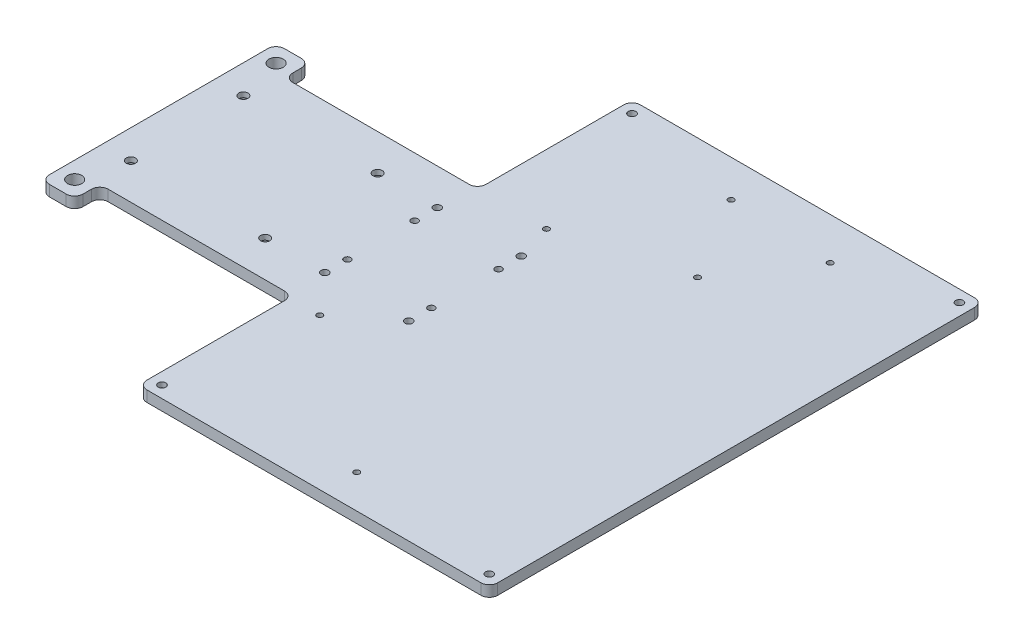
ISO-10303-21;
HEADER;
FILE_DESCRIPTION(('STEP AP214'),'2;1');
FILE_NAME('part.step','',(''),(''),'','','');
FILE_SCHEMA(('AUTOMOTIVE_DESIGN { 1 0 10303 214 1 1 1 1 }'));
ENDSEC;
DATA;
#1=APPLICATION_CONTEXT('core data for automotive mechanical design processes');
#2=APPLICATION_PROTOCOL_DEFINITION('international standard','automotive_design',2000,#1);
#3=PRODUCT_CONTEXT('',#1,'mechanical');
#4=PRODUCT('Part','Part','',(#3));
#5=PRODUCT_RELATED_PRODUCT_CATEGORY('part','',(#4));
#6=PRODUCT_DEFINITION_FORMATION('','',#4);
#7=PRODUCT_DEFINITION_CONTEXT('part definition',#1,'design');
#8=PRODUCT_DEFINITION('design','',#6,#7);
#9=PRODUCT_DEFINITION_SHAPE('','',#8);
#10=(LENGTH_UNIT() NAMED_UNIT(*) SI_UNIT(.MILLI.,.METRE.));
#11=(NAMED_UNIT(*) PLANE_ANGLE_UNIT() SI_UNIT($,.RADIAN.));
#12=(NAMED_UNIT(*) SI_UNIT($,.STERADIAN.) SOLID_ANGLE_UNIT());
#13=UNCERTAINTY_MEASURE_WITH_UNIT(LENGTH_MEASURE(1.E-05),#10,'distance_accuracy_value','');
#14=(GEOMETRIC_REPRESENTATION_CONTEXT(3) GLOBAL_UNCERTAINTY_ASSIGNED_CONTEXT((#13)) GLOBAL_UNIT_ASSIGNED_CONTEXT((#10,
#11,#12)) REPRESENTATION_CONTEXT('',''));
#15=CARTESIAN_POINT('',(0.,0.,0.));
#16=DIRECTION('',(0.,0.,1.));
#17=DIRECTION('',(1.,0.,0.));
#18=AXIS2_PLACEMENT_3D('',#15,#16,#17);
#19=CARTESIAN_POINT('',(-132.5,6.5,-70.));
#20=DIRECTION('',(0.,0.,1.));
#21=DIRECTION('',(1.,0.,0.));
#22=AXIS2_PLACEMENT_3D('',#19,#20,#21);
#23=PLANE('',#22);
#24=DIRECTION('',(-1.,0.,0.));
#25=VECTOR('',#24,1.);
#26=CARTESIAN_POINT('',(-132.5,6.5,-70.));
#27=LINE('',#26,#25);
#28=CARTESIAN_POINT('',(-117.5,6.5,-70.));
#29=VERTEX_POINT('',#28);
#30=CARTESIAN_POINT('',(-127.5,6.5,-70.));
#31=VERTEX_POINT('',#30);
#32=EDGE_CURVE('E226',#29,#31,#27,.T.);
#33=ORIENTED_EDGE('',*,*,#32,.F.);
#34=DIRECTION('',(0.,-1.,0.));
#35=VECTOR('',#34,1.);
#36=CARTESIAN_POINT('',(-117.5,6.5,-70.));
#37=LINE('',#36,#35);
#38=CARTESIAN_POINT('',(-117.5,0.,-70.));
#39=VERTEX_POINT('',#38);
#40=EDGE_CURVE('E252',#29,#39,#37,.T.);
#41=ORIENTED_EDGE('',*,*,#40,.T.);
#42=DIRECTION('',(-1.,0.,0.));
#43=VECTOR('',#42,1.);
#44=CARTESIAN_POINT('',(-132.5,0.,-70.));
#45=LINE('',#44,#43);
#46=CARTESIAN_POINT('',(-127.5,0.,-70.));
#47=VERTEX_POINT('',#46);
#48=EDGE_CURVE('E347',#39,#47,#45,.T.);
#49=ORIENTED_EDGE('',*,*,#48,.T.);
#50=DIRECTION('',(0.,-1.,0.));
#51=VECTOR('',#50,1.);
#52=CARTESIAN_POINT('',(-127.5,6.5,-70.));
#53=LINE('',#52,#51);
#54=EDGE_CURVE('E250',#47,#31,#53,.F.);
#55=ORIENTED_EDGE('',*,*,#54,.T.);
#56=EDGE_LOOP('',(#33,#41,#49,#55));
#57=FACE_BOUND('',#56,.T.);
#58=ADVANCED_FACE('F37',(#57),#23,.F.);
#59=CARTESIAN_POINT('',(-132.5,6.5,-70.));
#60=DIRECTION('',(1.,0.,0.));
#61=DIRECTION('',(0.,0.,-1.));
#62=AXIS2_PLACEMENT_3D('',#59,#60,#61);
#63=PLANE('',#62);
#64=DIRECTION('',(0.,0.,1.));
#65=VECTOR('',#64,1.);
#66=CARTESIAN_POINT('',(-132.5,6.5,-70.));
#67=LINE('',#66,#65);
#68=CARTESIAN_POINT('',(-132.5,6.5,-65.));
#69=VERTEX_POINT('',#68);
#70=CARTESIAN_POINT('',(-132.5,6.5,65.));
#71=VERTEX_POINT('',#70);
#72=EDGE_CURVE('E230',#69,#71,#67,.T.);
#73=ORIENTED_EDGE('',*,*,#72,.F.);
#74=DIRECTION('',(0.,-1.,0.));
#75=VECTOR('',#74,1.);
#76=CARTESIAN_POINT('',(-132.5,6.5,-65.));
#77=LINE('',#76,#75);
#78=CARTESIAN_POINT('',(-132.5,0.,-65.));
#79=VERTEX_POINT('',#78);
#80=EDGE_CURVE('E287',#69,#79,#77,.T.);
#81=ORIENTED_EDGE('',*,*,#80,.T.);
#82=DIRECTION('',(0.,0.,1.));
#83=VECTOR('',#82,1.);
#84=CARTESIAN_POINT('',(-132.5,0.,-70.));
#85=LINE('',#84,#83);
#86=CARTESIAN_POINT('',(-132.5,0.,65.));
#87=VERTEX_POINT('',#86);
#88=EDGE_CURVE('E350',#79,#87,#85,.T.);
#89=ORIENTED_EDGE('',*,*,#88,.T.);
#90=DIRECTION('',(0.,-1.,0.));
#91=VECTOR('',#90,1.);
#92=CARTESIAN_POINT('',(-132.5,6.5,65.));
#93=LINE('',#92,#91);
#94=EDGE_CURVE('E285',#87,#71,#93,.F.);
#95=ORIENTED_EDGE('',*,*,#94,.T.);
#96=EDGE_LOOP('',(#73,#81,#89,#95));
#97=FACE_BOUND('',#96,.T.);
#98=ADVANCED_FACE('F393',(#97),#63,.F.);
#99=CARTESIAN_POINT('',(-132.5,6.5,70.));
#100=DIRECTION('',(0.,0.,-1.));
#101=DIRECTION('',(-1.,0.,0.));
#102=AXIS2_PLACEMENT_3D('',#99,#100,#101);
#103=PLANE('',#102);
#104=DIRECTION('',(1.,0.,0.));
#105=VECTOR('',#104,1.);
#106=CARTESIAN_POINT('',(-132.5,6.5,70.));
#107=LINE('',#106,#105);
#108=CARTESIAN_POINT('',(-127.5,6.5,70.));
#109=VERTEX_POINT('',#108);
#110=CARTESIAN_POINT('',(-117.5,6.5,70.));
#111=VERTEX_POINT('',#110);
#112=EDGE_CURVE('E867',#109,#111,#107,.T.);
#113=ORIENTED_EDGE('',*,*,#112,.F.);
#114=DIRECTION('',(0.,-1.,0.));
#115=VECTOR('',#114,1.);
#116=CARTESIAN_POINT('',(-127.5,6.5,70.));
#117=LINE('',#116,#115);
#118=CARTESIAN_POINT('',(-127.5,0.,70.));
#119=VERTEX_POINT('',#118);
#120=EDGE_CURVE('E292',#109,#119,#117,.T.);
#121=ORIENTED_EDGE('',*,*,#120,.T.);
#122=DIRECTION('',(1.,0.,0.));
#123=VECTOR('',#122,1.);
#124=CARTESIAN_POINT('',(-132.5,0.,70.));
#125=LINE('',#124,#123);
#126=CARTESIAN_POINT('',(-117.5,0.,70.));
#127=VERTEX_POINT('',#126);
#128=EDGE_CURVE('E354',#119,#127,#125,.T.);
#129=ORIENTED_EDGE('',*,*,#128,.T.);
#130=DIRECTION('',(0.,-1.,0.));
#131=VECTOR('',#130,1.);
#132=CARTESIAN_POINT('',(-117.5,6.5,70.));
#133=LINE('',#132,#131);
#134=EDGE_CURVE('E290',#127,#111,#133,.F.);
#135=ORIENTED_EDGE('',*,*,#134,.T.);
#136=EDGE_LOOP('',(#113,#121,#129,#135));
#137=FACE_BOUND('',#136,.T.);
#138=ADVANCED_FACE('F399',(#137),#103,.F.);
#139=CARTESIAN_POINT('',(-112.5,6.5,55.));
#140=DIRECTION('',(-1.,0.,0.));
#141=DIRECTION('',(0.,0.,1.));
#142=AXIS2_PLACEMENT_3D('',#139,#140,#141);
#143=PLANE('',#142);
#144=DIRECTION('',(0.,0.,-1.));
#145=VECTOR('',#144,1.);
#146=CARTESIAN_POINT('',(-112.5,0.,55.));
#147=LINE('',#146,#145);
#148=CARTESIAN_POINT('',(-112.5,0.,65.));
#149=VERTEX_POINT('',#148);
#150=CARTESIAN_POINT('',(-112.5,0.,60.));
#151=VERTEX_POINT('',#150);
#152=EDGE_CURVE('E357',#149,#151,#147,.T.);
#153=ORIENTED_EDGE('',*,*,#152,.T.);
#154=DIRECTION('',(0.,-1.,0.));
#155=VECTOR('',#154,1.);
#156=CARTESIAN_POINT('',(-112.5,6.5,60.));
#157=LINE('',#156,#155);
#158=CARTESIAN_POINT('',(-112.5,6.5,60.));
#159=VERTEX_POINT('',#158);
#160=EDGE_CURVE('E248',#151,#159,#157,.F.);
#161=ORIENTED_EDGE('',*,*,#160,.T.);
#162=DIRECTION('',(0.,0.,-1.));
#163=VECTOR('',#162,1.);
#164=CARTESIAN_POINT('',(-112.5,6.5,55.));
#165=LINE('',#164,#163);
#166=CARTESIAN_POINT('',(-112.5,6.5,65.));
#167=VERTEX_POINT('',#166);
#168=EDGE_CURVE('E872',#167,#159,#165,.T.);
#169=ORIENTED_EDGE('',*,*,#168,.F.);
#170=DIRECTION('',(0.,-1.,0.));
#171=VECTOR('',#170,1.);
#172=CARTESIAN_POINT('',(-112.5,6.5,65.));
#173=LINE('',#172,#171);
#174=EDGE_CURVE('E245',#167,#149,#173,.T.);
#175=ORIENTED_EDGE('',*,*,#174,.T.);
#176=EDGE_LOOP('',(#153,#161,#169,#175));
#177=FACE_BOUND('',#176,.T.);
#178=ADVANCED_FACE('F857',(#177),#143,.F.);
#179=CARTESIAN_POINT('',(-112.5,6.5,55.));
#180=DIRECTION('',(0.,0.,-1.));
#181=DIRECTION('',(-1.,0.,0.));
#182=AXIS2_PLACEMENT_3D('',#179,#180,#181);
#183=PLANE('',#182);
#184=DIRECTION('',(1.,0.,0.));
#185=VECTOR('',#184,1.);
#186=CARTESIAN_POINT('',(-112.5,6.5,55.));
#187=LINE('',#186,#185);
#188=CARTESIAN_POINT('',(-107.5,6.5,55.));
#189=VERTEX_POINT('',#188);
#190=CARTESIAN_POINT('',(-2.5,6.5,55.));
#191=VERTEX_POINT('',#190);
#192=EDGE_CURVE('E889',#189,#191,#187,.T.);
#193=ORIENTED_EDGE('',*,*,#192,.F.);
#194=DIRECTION('',(0.,-1.,0.));
#195=VECTOR('',#194,1.);
#196=CARTESIAN_POINT('',(-107.5,0.,55.));
#197=LINE('',#196,#195);
#198=CARTESIAN_POINT('',(-107.5,0.,55.));
#199=VERTEX_POINT('',#198);
#200=EDGE_CURVE('E242',#189,#199,#197,.T.);
#201=ORIENTED_EDGE('',*,*,#200,.T.);
#202=DIRECTION('',(1.,0.,0.));
#203=VECTOR('',#202,1.);
#204=CARTESIAN_POINT('',(-112.5,0.,55.));
#205=LINE('',#204,#203);
#206=CARTESIAN_POINT('',(-2.5,0.,55.));
#207=VERTEX_POINT('',#206);
#208=EDGE_CURVE('E360',#199,#207,#205,.T.);
#209=ORIENTED_EDGE('',*,*,#208,.T.);
#210=DIRECTION('',(0.,-1.,0.));
#211=VECTOR('',#210,1.);
#212=CARTESIAN_POINT('',(-2.5,6.5,55.));
#213=LINE('',#212,#211);
#214=EDGE_CURVE('E240',#207,#191,#213,.F.);
#215=ORIENTED_EDGE('',*,*,#214,.T.);
#216=EDGE_LOOP('',(#193,#201,#209,#215));
#217=FACE_BOUND('',#216,.T.);
#218=ADVANCED_FACE('F853',(#217),#183,.F.);
#219=CARTESIAN_POINT('',(2.5,6.5,55.));
#220=DIRECTION('',(1.,0.,0.));
#221=DIRECTION('',(0.,0.,-1.));
#222=AXIS2_PLACEMENT_3D('',#219,#220,#221);
#223=PLANE('',#222);
#224=DIRECTION('',(0.,0.,1.));
#225=VECTOR('',#224,1.);
#226=CARTESIAN_POINT('',(2.5,6.5,55.));
#227=LINE('',#226,#225);
#228=CARTESIAN_POINT('',(2.5,6.5,60.));
#229=VERTEX_POINT('',#228);
#230=CARTESIAN_POINT('',(2.5,6.5,142.));
#231=VERTEX_POINT('',#230);
#232=EDGE_CURVE('E892',#229,#231,#227,.T.);
#233=ORIENTED_EDGE('',*,*,#232,.F.);
#234=DIRECTION('',(0.,-1.,0.));
#235=VECTOR('',#234,1.);
#236=CARTESIAN_POINT('',(2.5,0.,60.));
#237=LINE('',#236,#235);
#238=CARTESIAN_POINT('',(2.5,0.,60.));
#239=VERTEX_POINT('',#238);
#240=EDGE_CURVE('E297',#229,#239,#237,.T.);
#241=ORIENTED_EDGE('',*,*,#240,.T.);
#242=DIRECTION('',(0.,0.,1.));
#243=VECTOR('',#242,1.);
#244=CARTESIAN_POINT('',(2.5,0.,55.));
#245=LINE('',#244,#243);
#246=CARTESIAN_POINT('',(2.5,0.,142.));
#247=VERTEX_POINT('',#246);
#248=EDGE_CURVE('E363',#239,#247,#245,.T.);
#249=ORIENTED_EDGE('',*,*,#248,.T.);
#250=DIRECTION('',(0.,-1.,0.));
#251=VECTOR('',#250,1.);
#252=CARTESIAN_POINT('',(2.5,6.5,142.));
#253=LINE('',#252,#251);
#254=EDGE_CURVE('E295',#247,#231,#253,.F.);
#255=ORIENTED_EDGE('',*,*,#254,.T.);
#256=EDGE_LOOP('',(#233,#241,#249,#255));
#257=FACE_BOUND('',#256,.T.);
#258=ADVANCED_FACE('F849',(#257),#223,.F.);
#259=CARTESIAN_POINT('',(211.5,6.5,147.));
#260=DIRECTION('',(0.,0.,-1.));
#261=DIRECTION('',(-1.,0.,0.));
#262=AXIS2_PLACEMENT_3D('',#259,#260,#261);
#263=PLANE('',#262);
#264=DIRECTION('',(1.,0.,0.));
#265=VECTOR('',#264,1.);
#266=CARTESIAN_POINT('',(211.5,6.5,147.));
#267=LINE('',#266,#265);
#268=CARTESIAN_POINT('',(7.50000000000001,6.5,147.));
#269=VERTEX_POINT('',#268);
#270=CARTESIAN_POINT('',(206.5,6.5,147.));
#271=VERTEX_POINT('',#270);
#272=EDGE_CURVE('E895',#269,#271,#267,.T.);
#273=ORIENTED_EDGE('',*,*,#272,.F.);
#274=DIRECTION('',(0.,-1.,0.));
#275=VECTOR('',#274,1.);
#276=CARTESIAN_POINT('',(7.50000000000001,6.5,147.));
#277=LINE('',#276,#275);
#278=CARTESIAN_POINT('',(7.50000000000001,0.,147.));
#279=VERTEX_POINT('',#278);
#280=EDGE_CURVE('E306',#269,#279,#277,.T.);
#281=ORIENTED_EDGE('',*,*,#280,.T.);
#282=DIRECTION('',(1.,0.,0.));
#283=VECTOR('',#282,1.);
#284=CARTESIAN_POINT('',(211.5,0.,147.));
#285=LINE('',#284,#283);
#286=CARTESIAN_POINT('',(206.5,0.,147.));
#287=VERTEX_POINT('',#286);
#288=EDGE_CURVE('E366',#279,#287,#285,.T.);
#289=ORIENTED_EDGE('',*,*,#288,.T.);
#290=DIRECTION('',(0.,-1.,0.));
#291=VECTOR('',#290,1.);
#292=CARTESIAN_POINT('',(206.5,6.5,147.));
#293=LINE('',#292,#291);
#294=EDGE_CURVE('E304',#287,#271,#293,.F.);
#295=ORIENTED_EDGE('',*,*,#294,.T.);
#296=EDGE_LOOP('',(#273,#281,#289,#295));
#297=FACE_BOUND('',#296,.T.);
#298=ADVANCED_FACE('F845',(#297),#263,.F.);
#299=CARTESIAN_POINT('',(211.5,6.5,147.));
#300=DIRECTION('',(-1.,0.,0.));
#301=DIRECTION('',(0.,0.,1.));
#302=AXIS2_PLACEMENT_3D('',#299,#300,#301);
#303=PLANE('',#302);
#304=DIRECTION('',(0.,0.,-1.));
#305=VECTOR('',#304,1.);
#306=CARTESIAN_POINT('',(211.5,0.,147.));
#307=LINE('',#306,#305);
#308=CARTESIAN_POINT('',(211.5,0.,142.));
#309=VERTEX_POINT('',#308);
#310=CARTESIAN_POINT('',(211.5,0.,-142.));
#311=VERTEX_POINT('',#310);
#312=EDGE_CURVE('E369',#309,#311,#307,.T.);
#313=ORIENTED_EDGE('',*,*,#312,.T.);
#314=DIRECTION('',(0.,-1.,0.));
#315=VECTOR('',#314,1.);
#316=CARTESIAN_POINT('',(211.5,6.5,-142.));
#317=LINE('',#316,#315);
#318=CARTESIAN_POINT('',(211.5,6.5,-142.));
#319=VERTEX_POINT('',#318);
#320=EDGE_CURVE('E210',#311,#319,#317,.F.);
#321=ORIENTED_EDGE('',*,*,#320,.T.);
#322=DIRECTION('',(0.,0.,-1.));
#323=VECTOR('',#322,1.);
#324=CARTESIAN_POINT('',(211.5,6.5,147.));
#325=LINE('',#324,#323);
#326=CARTESIAN_POINT('',(211.5,6.5,142.));
#327=VERTEX_POINT('',#326);
#328=EDGE_CURVE('E898',#327,#319,#325,.T.);
#329=ORIENTED_EDGE('',*,*,#328,.F.);
#330=DIRECTION('',(0.,-1.,0.));
#331=VECTOR('',#330,1.);
#332=CARTESIAN_POINT('',(211.5,6.5,142.));
#333=LINE('',#332,#331);
#334=EDGE_CURVE('E314',#327,#309,#333,.T.);
#335=ORIENTED_EDGE('',*,*,#334,.T.);
#336=EDGE_LOOP('',(#313,#321,#329,#335));
#337=FACE_BOUND('',#336,.T.);
#338=ADVANCED_FACE('F842',(#337),#303,.F.);
#339=CARTESIAN_POINT('',(2.49999999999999,6.5,-147.));
#340=DIRECTION('',(0.,0.,1.));
#341=DIRECTION('',(1.,0.,0.));
#342=AXIS2_PLACEMENT_3D('',#339,#340,#341);
#343=PLANE('',#342);
#344=DIRECTION('',(-1.,0.,0.));
#345=VECTOR('',#344,1.);
#346=CARTESIAN_POINT('',(2.49999999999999,0.,-147.));
#347=LINE('',#346,#345);
#348=CARTESIAN_POINT('',(206.5,0.,-147.));
#349=VERTEX_POINT('',#348);
#350=CARTESIAN_POINT('',(7.49999999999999,0.,-147.));
#351=VERTEX_POINT('',#350);
#352=EDGE_CURVE('E331',#349,#351,#347,.T.);
#353=ORIENTED_EDGE('',*,*,#352,.T.);
#354=DIRECTION('',(0.,-1.,0.));
#355=VECTOR('',#354,1.);
#356=CARTESIAN_POINT('',(7.49999999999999,6.5,-147.));
#357=LINE('',#356,#355);
#358=CARTESIAN_POINT('',(7.49999999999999,6.5,-147.));
#359=VERTEX_POINT('',#358);
#360=EDGE_CURVE('E312',#351,#359,#357,.F.);
#361=ORIENTED_EDGE('',*,*,#360,.T.);
#362=DIRECTION('',(-1.,0.,0.));
#363=VECTOR('',#362,1.);
#364=CARTESIAN_POINT('',(2.49999999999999,6.5,-147.));
#365=LINE('',#364,#363);
#366=CARTESIAN_POINT('',(206.5,6.5,-147.));
#367=VERTEX_POINT('',#366);
#368=EDGE_CURVE('E343',#367,#359,#365,.T.);
#369=ORIENTED_EDGE('',*,*,#368,.F.);
#370=DIRECTION('',(0.,-1.,0.));
#371=VECTOR('',#370,1.);
#372=CARTESIAN_POINT('',(206.5,6.5,-147.));
#373=LINE('',#372,#371);
#374=EDGE_CURVE('E309',#367,#349,#373,.T.);
#375=ORIENTED_EDGE('',*,*,#374,.T.);
#376=EDGE_LOOP('',(#353,#361,#369,#375));
#377=FACE_BOUND('',#376,.T.);
#378=ADVANCED_FACE('F376',(#377),#343,.F.);
#379=CARTESIAN_POINT('',(2.5,6.5,-55.));
#380=DIRECTION('',(1.,0.,0.));
#381=DIRECTION('',(0.,0.,-1.));
#382=AXIS2_PLACEMENT_3D('',#379,#380,#381);
#383=PLANE('',#382);
#384=DIRECTION('',(0.,0.,1.));
#385=VECTOR('',#384,1.);
#386=CARTESIAN_POINT('',(2.5,0.,-55.));
#387=LINE('',#386,#385);
#388=CARTESIAN_POINT('',(2.49999999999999,0.,-142.));
#389=VERTEX_POINT('',#388);
#390=CARTESIAN_POINT('',(2.5,0.,-60.));
#391=VERTEX_POINT('',#390);
#392=EDGE_CURVE('E232',#389,#391,#387,.T.);
#393=ORIENTED_EDGE('',*,*,#392,.T.);
#394=DIRECTION('',(0.,-1.,0.));
#395=VECTOR('',#394,1.);
#396=CARTESIAN_POINT('',(2.5,6.5,-60.));
#397=LINE('',#396,#395);
#398=CARTESIAN_POINT('',(2.5,6.5,-60.));
#399=VERTEX_POINT('',#398);
#400=EDGE_CURVE('E52',#391,#399,#397,.F.);
#401=ORIENTED_EDGE('',*,*,#400,.T.);
#402=DIRECTION('',(0.,0.,1.));
#403=VECTOR('',#402,1.);
#404=CARTESIAN_POINT('',(2.5,6.5,-55.));
#405=LINE('',#404,#403);
#406=CARTESIAN_POINT('',(2.49999999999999,6.5,-142.));
#407=VERTEX_POINT('',#406);
#408=EDGE_CURVE('E338',#407,#399,#405,.T.);
#409=ORIENTED_EDGE('',*,*,#408,.F.);
#410=DIRECTION('',(0.,-1.,0.));
#411=VECTOR('',#410,1.);
#412=CARTESIAN_POINT('',(2.49999999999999,6.5,-142.));
#413=LINE('',#412,#411);
#414=EDGE_CURVE('E300',#407,#389,#413,.T.);
#415=ORIENTED_EDGE('',*,*,#414,.T.);
#416=EDGE_LOOP('',(#393,#401,#409,#415));
#417=FACE_BOUND('',#416,.T.);
#418=ADVANCED_FACE('F329',(#417),#383,.F.);
#419=CARTESIAN_POINT('',(-112.5,6.5,-55.));
#420=DIRECTION('',(0.,0.,1.));
#421=DIRECTION('',(1.,0.,0.));
#422=AXIS2_PLACEMENT_3D('',#419,#420,#421);
#423=PLANE('',#422);
#424=DIRECTION('',(-1.,0.,0.));
#425=VECTOR('',#424,1.);
#426=CARTESIAN_POINT('',(-112.5,0.,-55.));
#427=LINE('',#426,#425);
#428=CARTESIAN_POINT('',(-2.5,0.,-55.));
#429=VERTEX_POINT('',#428);
#430=CARTESIAN_POINT('',(-107.5,0.,-55.));
#431=VERTEX_POINT('',#430);
#432=EDGE_CURVE('E227',#429,#431,#427,.T.);
#433=ORIENTED_EDGE('',*,*,#432,.T.);
#434=DIRECTION('',(0.,-1.,0.));
#435=VECTOR('',#434,1.);
#436=CARTESIAN_POINT('',(-107.5,6.5,-55.));
#437=LINE('',#436,#435);
#438=CARTESIAN_POINT('',(-107.5,6.5,-55.));
#439=VERTEX_POINT('',#438);
#440=EDGE_CURVE('E204',#431,#439,#437,.F.);
#441=ORIENTED_EDGE('',*,*,#440,.T.);
#442=DIRECTION('',(-1.,0.,0.));
#443=VECTOR('',#442,1.);
#444=CARTESIAN_POINT('',(-112.5,6.5,-55.));
#445=LINE('',#444,#443);
#446=CARTESIAN_POINT('',(-2.5,6.5,-55.));
#447=VERTEX_POINT('',#446);
#448=EDGE_CURVE('E337',#447,#439,#445,.T.);
#449=ORIENTED_EDGE('',*,*,#448,.F.);
#450=DIRECTION('',(0.,-1.,0.));
#451=VECTOR('',#450,1.);
#452=CARTESIAN_POINT('',(-2.5,0.,-55.));
#453=LINE('',#452,#451);
#454=EDGE_CURVE('E220',#447,#429,#453,.T.);
#455=ORIENTED_EDGE('',*,*,#454,.T.);
#456=EDGE_LOOP('',(#433,#441,#449,#455));
#457=FACE_BOUND('',#456,.T.);
#458=ADVANCED_FACE('F340',(#457),#423,.F.);
#459=CARTESIAN_POINT('',(-112.5,6.5,-70.));
#460=DIRECTION('',(-1.,0.,0.));
#461=DIRECTION('',(0.,0.,1.));
#462=AXIS2_PLACEMENT_3D('',#459,#460,#461);
#463=PLANE('',#462);
#464=DIRECTION('',(0.,0.,-1.));
#465=VECTOR('',#464,1.);
#466=CARTESIAN_POINT('',(-112.5,6.5,-70.));
#467=LINE('',#466,#465);
#468=CARTESIAN_POINT('',(-112.5,6.5,-60.));
#469=VERTEX_POINT('',#468);
#470=CARTESIAN_POINT('',(-112.5,6.5,-65.));
#471=VERTEX_POINT('',#470);
#472=EDGE_CURVE('E219',#469,#471,#467,.T.);
#473=ORIENTED_EDGE('',*,*,#472,.F.);
#474=DIRECTION('',(0.,-1.,0.));
#475=VECTOR('',#474,1.);
#476=CARTESIAN_POINT('',(-112.5,0.,-60.));
#477=LINE('',#476,#475);
#478=CARTESIAN_POINT('',(-112.5,0.,-60.));
#479=VERTEX_POINT('',#478);
#480=EDGE_CURVE('E203',#469,#479,#477,.T.);
#481=ORIENTED_EDGE('',*,*,#480,.T.);
#482=DIRECTION('',(0.,0.,-1.));
#483=VECTOR('',#482,1.);
#484=CARTESIAN_POINT('',(-112.5,0.,-70.));
#485=LINE('',#484,#483);
#486=CARTESIAN_POINT('',(-112.5,0.,-65.));
#487=VERTEX_POINT('',#486);
#488=EDGE_CURVE('E216',#479,#487,#485,.T.);
#489=ORIENTED_EDGE('',*,*,#488,.T.);
#490=DIRECTION('',(0.,-1.,0.));
#491=VECTOR('',#490,1.);
#492=CARTESIAN_POINT('',(-112.5,6.5,-65.));
#493=LINE('',#492,#491);
#494=EDGE_CURVE('E221',#487,#471,#493,.F.);
#495=ORIENTED_EDGE('',*,*,#494,.T.);
#496=EDGE_LOOP('',(#473,#481,#489,#495));
#497=FACE_BOUND('',#496,.T.);
#498=ADVANCED_FACE('F215',(#497),#463,.F.);
#499=CARTESIAN_POINT('',(0.,6.5,0.));
#500=DIRECTION('',(0.,-1.,0.));
#501=DIRECTION('',(0.,0.,-1.));
#502=AXIS2_PLACEMENT_3D('',#499,#500,#501);
#503=PLANE('',#502);
#504=CARTESIAN_POINT('',(112.5,6.5,127.));
#505=DIRECTION('',(0.,-1.,0.));
#506=DIRECTION('',(0.,0.,-1.));
#507=AXIS2_PLACEMENT_3D('',#504,#505,#506);
#508=CIRCLE('',#507,1.69999999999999);
#509=CARTESIAN_POINT('',(112.5,6.5,125.3));
#510=VERTEX_POINT('',#509);
#511=EDGE_CURVE('E1164',#510,#510,#508,.T.);
#512=ORIENTED_EDGE('',*,*,#511,.T.);
#513=EDGE_LOOP('',(#512));
#514=FACE_BOUND('',#513,.T.);
#515=CARTESIAN_POINT('',(20.5,6.5,57.));
#516=DIRECTION('',(0.,-1.,0.));
#517=DIRECTION('',(0.,0.,-1.));
#518=AXIS2_PLACEMENT_3D('',#515,#516,#517);
#519=CIRCLE('',#518,1.7);
#520=CARTESIAN_POINT('',(20.5,6.5,55.3));
#521=VERTEX_POINT('',#520);
#522=EDGE_CURVE('E1152',#521,#521,#519,.T.);
#523=ORIENTED_EDGE('',*,*,#522,.T.);
#524=EDGE_LOOP('',(#523));
#525=FACE_BOUND('',#524,.T.);
#526=CARTESIAN_POINT('',(145.5,6.5,-122.));
#527=DIRECTION('',(0.,-1.,0.));
#528=DIRECTION('',(0.,0.,-1.));
#529=AXIS2_PLACEMENT_3D('',#526,#527,#528);
#530=CIRCLE('',#529,1.70000000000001);
#531=CARTESIAN_POINT('',(145.5,6.5,-123.7));
#532=VERTEX_POINT('',#531);
#533=EDGE_CURVE('E1140',#532,#532,#530,.T.);
#534=ORIENTED_EDGE('',*,*,#533,.T.);
#535=EDGE_LOOP('',(#534));
#536=FACE_BOUND('',#535,.T.);
#537=CARTESIAN_POINT('',(113.5,6.5,-75.));
#538=DIRECTION('',(0.,-1.,0.));
#539=DIRECTION('',(0.,0.,-1.));
#540=AXIS2_PLACEMENT_3D('',#537,#538,#539);
#541=CIRCLE('',#540,1.69999999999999);
#542=CARTESIAN_POINT('',(113.5,6.5,-76.7));
#543=VERTEX_POINT('',#542);
#544=EDGE_CURVE('E1128',#543,#543,#541,.T.);
#545=ORIENTED_EDGE('',*,*,#544,.T.);
#546=EDGE_LOOP('',(#545));
#547=FACE_BOUND('',#546,.T.);
#548=CARTESIAN_POINT('',(43.5,6.5,-55.));
#549=DIRECTION('',(0.,-1.,0.));
#550=DIRECTION('',(0.,0.,-1.));
#551=AXIS2_PLACEMENT_3D('',#548,#549,#550);
#552=CIRCLE('',#551,1.7);
#553=CARTESIAN_POINT('',(43.5,6.5,-56.7));
#554=VERTEX_POINT('',#553);
#555=EDGE_CURVE('E1116',#554,#554,#552,.T.);
#556=ORIENTED_EDGE('',*,*,#555,.T.);
#557=EDGE_LOOP('',(#556));
#558=FACE_BOUND('',#557,.T.);
#559=CARTESIAN_POINT('',(83.5,6.5,-125.));
#560=DIRECTION('',(0.,-1.,0.));
#561=DIRECTION('',(0.,0.,-1.));
#562=AXIS2_PLACEMENT_3D('',#559,#560,#561);
#563=CIRCLE('',#562,1.69999999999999);
#564=CARTESIAN_POINT('',(83.5,6.5,-126.7));
#565=VERTEX_POINT('',#564);
#566=EDGE_CURVE('E1104',#565,#565,#563,.T.);
#567=ORIENTED_EDGE('',*,*,#566,.T.);
#568=EDGE_LOOP('',(#567));
#569=FACE_BOUND('',#568,.T.);
#570=CARTESIAN_POINT('',(50.,6.5,33.5));
#571=DIRECTION('',(0.,-1.,0.));
#572=DIRECTION('',(0.,0.,-1.));
#573=AXIS2_PLACEMENT_3D('',#570,#571,#572);
#574=CIRCLE('',#573,2.25);
#575=CARTESIAN_POINT('',(50.,6.5,31.25));
#576=VERTEX_POINT('',#575);
#577=EDGE_CURVE('E1092',#576,#576,#574,.T.);
#578=ORIENTED_EDGE('',*,*,#577,.T.);
#579=EDGE_LOOP('',(#578));
#580=FACE_BOUND('',#579,.T.);
#581=CARTESIAN_POINT('',(50.,6.5,-33.5));
#582=DIRECTION('',(0.,-1.,0.));
#583=DIRECTION('',(0.,0.,-1.));
#584=AXIS2_PLACEMENT_3D('',#581,#582,#583);
#585=CIRCLE('',#584,2.25);
#586=CARTESIAN_POINT('',(50.,6.5,-35.75));
#587=VERTEX_POINT('',#586);
#588=EDGE_CURVE('E1080',#587,#587,#585,.T.);
#589=ORIENTED_EDGE('',*,*,#588,.T.);
#590=EDGE_LOOP('',(#589));
#591=FACE_BOUND('',#590,.T.);
#592=CARTESIAN_POINT('',(0.,6.5,33.5));
#593=DIRECTION('',(0.,-1.,0.));
#594=DIRECTION('',(0.,0.,-1.));
#595=AXIS2_PLACEMENT_3D('',#592,#593,#594);
#596=CIRCLE('',#595,2.25);
#597=CARTESIAN_POINT('',(0.,6.5,31.25));
#598=VERTEX_POINT('',#597);
#599=EDGE_CURVE('E1068',#598,#598,#596,.T.);
#600=ORIENTED_EDGE('',*,*,#599,.T.);
#601=EDGE_LOOP('',(#600));
#602=FACE_BOUND('',#601,.T.);
#603=CARTESIAN_POINT('',(0.,6.5,-33.5));
#604=DIRECTION('',(0.,-1.,0.));
#605=DIRECTION('',(0.,0.,-1.));
#606=AXIS2_PLACEMENT_3D('',#603,#604,#605);
#607=CIRCLE('',#606,2.25);
#608=CARTESIAN_POINT('',(0.,6.5,-35.75));
#609=VERTEX_POINT('',#608);
#610=EDGE_CURVE('E1056',#609,#609,#607,.T.);
#611=ORIENTED_EDGE('',*,*,#610,.T.);
#612=EDGE_LOOP('',(#611));
#613=FACE_BOUND('',#612,.T.);
#614=CARTESIAN_POINT('',(204.5,6.5,140.));
#615=DIRECTION('',(0.,-1.,0.));
#616=DIRECTION('',(0.,0.,-1.));
#617=AXIS2_PLACEMENT_3D('',#614,#615,#616);
#618=CIRCLE('',#617,2.25);
#619=CARTESIAN_POINT('',(204.5,6.5,137.75));
#620=VERTEX_POINT('',#619);
#621=EDGE_CURVE('E1044',#620,#620,#618,.T.);
#622=ORIENTED_EDGE('',*,*,#621,.T.);
#623=EDGE_LOOP('',(#622));
#624=FACE_BOUND('',#623,.T.);
#625=CARTESIAN_POINT('',(9.50000000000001,6.5,140.));
#626=DIRECTION('',(0.,-1.,0.));
#627=DIRECTION('',(0.,0.,-1.));
#628=AXIS2_PLACEMENT_3D('',#625,#626,#627);
#629=CIRCLE('',#628,2.25);
#630=CARTESIAN_POINT('',(9.50000000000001,6.5,137.75));
#631=VERTEX_POINT('',#630);
#632=EDGE_CURVE('E1032',#631,#631,#629,.T.);
#633=ORIENTED_EDGE('',*,*,#632,.T.);
#634=EDGE_LOOP('',(#633));
#635=FACE_BOUND('',#634,.T.);
#636=CARTESIAN_POINT('',(9.49999999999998,6.5,-140.));
#637=DIRECTION('',(0.,-1.,0.));
#638=DIRECTION('',(0.,0.,-1.));
#639=AXIS2_PLACEMENT_3D('',#636,#637,#638);
#640=CIRCLE('',#639,2.25);
#641=CARTESIAN_POINT('',(9.49999999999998,6.5,-142.25));
#642=VERTEX_POINT('',#641);
#643=EDGE_CURVE('E1020',#642,#642,#640,.T.);
#644=ORIENTED_EDGE('',*,*,#643,.T.);
#645=EDGE_LOOP('',(#644));
#646=FACE_BOUND('',#645,.T.);
#647=CARTESIAN_POINT('',(204.5,6.5,-140.));
#648=DIRECTION('',(0.,-1.,0.));
#649=DIRECTION('',(0.,0.,-1.));
#650=AXIS2_PLACEMENT_3D('',#647,#648,#649);
#651=CIRCLE('',#650,2.25);
#652=CARTESIAN_POINT('',(204.5,6.5,-142.25));
#653=VERTEX_POINT('',#652);
#654=EDGE_CURVE('E1008',#653,#653,#651,.T.);
#655=ORIENTED_EDGE('',*,*,#654,.T.);
#656=EDGE_LOOP('',(#655));
#657=FACE_BOUND('',#656,.T.);
#658=CARTESIAN_POINT('',(0.,6.5,20.));
#659=DIRECTION('',(0.,-1.,0.));
#660=DIRECTION('',(0.,0.,-1.));
#661=AXIS2_PLACEMENT_3D('',#658,#659,#660);
#662=CIRCLE('',#661,2.);
#663=CARTESIAN_POINT('',(0.,6.5,18.));
#664=VERTEX_POINT('',#663);
#665=EDGE_CURVE('E1002',#664,#664,#662,.T.);
#666=ORIENTED_EDGE('',*,*,#665,.T.);
#667=EDGE_LOOP('',(#666));
#668=FACE_BOUND('',#667,.T.);
#669=CARTESIAN_POINT('',(0.,6.5,-20.));
#670=DIRECTION('',(0.,-1.,0.));
#671=DIRECTION('',(0.,0.,-1.));
#672=AXIS2_PLACEMENT_3D('',#669,#670,#671);
#673=CIRCLE('',#672,2.);
#674=CARTESIAN_POINT('',(0.,6.5,-22.));
#675=VERTEX_POINT('',#674);
#676=EDGE_CURVE('E996',#675,#675,#673,.T.);
#677=ORIENTED_EDGE('',*,*,#676,.T.);
#678=EDGE_LOOP('',(#677));
#679=FACE_BOUND('',#678,.T.);
#680=CARTESIAN_POINT('',(50.,6.5,20.));
#681=DIRECTION('',(0.,-1.,0.));
#682=DIRECTION('',(0.,0.,-1.));
#683=AXIS2_PLACEMENT_3D('',#680,#681,#682);
#684=CIRCLE('',#683,2.);
#685=CARTESIAN_POINT('',(50.,6.5,18.));
#686=VERTEX_POINT('',#685);
#687=EDGE_CURVE('E990',#686,#686,#684,.T.);
#688=ORIENTED_EDGE('',*,*,#687,.T.);
#689=EDGE_LOOP('',(#688));
#690=FACE_BOUND('',#689,.T.);
#691=CARTESIAN_POINT('',(50.,6.5,-20.));
#692=DIRECTION('',(0.,-1.,0.));
#693=DIRECTION('',(0.,0.,-1.));
#694=AXIS2_PLACEMENT_3D('',#691,#692,#693);
#695=CIRCLE('',#694,2.);
#696=CARTESIAN_POINT('',(50.,6.5,-22.));
#697=VERTEX_POINT('',#696);
#698=EDGE_CURVE('E984',#697,#697,#695,.T.);
#699=ORIENTED_EDGE('',*,*,#698,.T.);
#700=EDGE_LOOP('',(#699));
#701=FACE_BOUND('',#700,.T.);
#702=CARTESIAN_POINT('',(-115.5,6.5,33.5));
#703=DIRECTION('',(0.,-1.,0.));
#704=DIRECTION('',(0.,0.,-1.));
#705=AXIS2_PLACEMENT_3D('',#702,#703,#704);
#706=CIRCLE('',#705,2.75);
#707=CARTESIAN_POINT('',(-115.5,6.5,30.75));
#708=VERTEX_POINT('',#707);
#709=EDGE_CURVE('E972',#708,#708,#706,.T.);
#710=ORIENTED_EDGE('',*,*,#709,.T.);
#711=EDGE_LOOP('',(#710));
#712=FACE_BOUND('',#711,.T.);
#713=CARTESIAN_POINT('',(-35.5,6.5,33.5));
#714=DIRECTION('',(0.,-1.,0.));
#715=DIRECTION('',(0.,0.,-1.));
#716=AXIS2_PLACEMENT_3D('',#713,#714,#715);
#717=CIRCLE('',#716,2.75);
#718=CARTESIAN_POINT('',(-35.5,6.5,30.75));
#719=VERTEX_POINT('',#718);
#720=EDGE_CURVE('E960',#719,#719,#717,.T.);
#721=ORIENTED_EDGE('',*,*,#720,.T.);
#722=EDGE_LOOP('',(#721));
#723=FACE_BOUND('',#722,.T.);
#724=CARTESIAN_POINT('',(-35.5,6.5,-33.5));
#725=DIRECTION('',(0.,-1.,0.));
#726=DIRECTION('',(0.,0.,-1.));
#727=AXIS2_PLACEMENT_3D('',#724,#725,#726);
#728=CIRCLE('',#727,2.75);
#729=CARTESIAN_POINT('',(-35.5,6.5,-36.25));
#730=VERTEX_POINT('',#729);
#731=EDGE_CURVE('E948',#730,#730,#728,.T.);
#732=ORIENTED_EDGE('',*,*,#731,.T.);
#733=EDGE_LOOP('',(#732));
#734=FACE_BOUND('',#733,.T.);
#735=CARTESIAN_POINT('',(-115.5,6.5,-33.5));
#736=DIRECTION('',(0.,-1.,0.));
#737=DIRECTION('',(0.,0.,-1.));
#738=AXIS2_PLACEMENT_3D('',#735,#736,#737);
#739=CIRCLE('',#738,2.75);
#740=CARTESIAN_POINT('',(-115.5,6.5,-36.25));
#741=VERTEX_POINT('',#740);
#742=EDGE_CURVE('E936',#741,#741,#739,.T.);
#743=ORIENTED_EDGE('',*,*,#742,.T.);
#744=EDGE_LOOP('',(#743));
#745=FACE_BOUND('',#744,.T.);
#746=CARTESIAN_POINT('',(-122.5,6.5,-60.));
#747=DIRECTION('',(0.,1.,0.));
#748=DIRECTION('',(0.,0.,1.));
#749=AXIS2_PLACEMENT_3D('',#746,#747,#748);
#750=CIRCLE('',#749,4.25);
#751=CARTESIAN_POINT('',(-122.5,6.5,-55.75));
#752=VERTEX_POINT('',#751);
#753=EDGE_CURVE('E933',#752,#752,#750,.T.);
#754=ORIENTED_EDGE('',*,*,#753,.F.);
#755=EDGE_LOOP('',(#754));
#756=FACE_BOUND('',#755,.T.);
#757=CARTESIAN_POINT('',(-122.5,6.5,60.));
#758=DIRECTION('',(0.,1.,0.));
#759=DIRECTION('',(0.,0.,1.));
#760=AXIS2_PLACEMENT_3D('',#757,#758,#759);
#761=CIRCLE('',#760,4.25);
#762=CARTESIAN_POINT('',(-122.5,6.5,64.25));
#763=VERTEX_POINT('',#762);
#764=EDGE_CURVE('E927',#763,#763,#761,.T.);
#765=ORIENTED_EDGE('',*,*,#764,.F.);
#766=EDGE_LOOP('',(#765));
#767=FACE_BOUND('',#766,.T.);
#768=ORIENTED_EDGE('',*,*,#472,.T.);
#769=CARTESIAN_POINT('',(-117.5,6.5,-65.));
#770=DIRECTION('',(0.,-1.,0.));
#771=DIRECTION('',(0.,0.,-1.));
#772=AXIS2_PLACEMENT_3D('',#769,#770,#771);
#773=CIRCLE('',#772,5.);
#774=EDGE_CURVE('E283',#471,#29,#773,.F.);
#775=ORIENTED_EDGE('',*,*,#774,.T.);
#776=ORIENTED_EDGE('',*,*,#32,.T.);
#777=CARTESIAN_POINT('',(-127.5,6.5,-65.));
#778=DIRECTION('',(0.,-1.,0.));
#779=DIRECTION('',(0.,0.,-1.));
#780=AXIS2_PLACEMENT_3D('',#777,#778,#779);
#781=CIRCLE('',#780,5.);
#782=EDGE_CURVE('E281',#31,#69,#781,.F.);
#783=ORIENTED_EDGE('',*,*,#782,.T.);
#784=ORIENTED_EDGE('',*,*,#72,.T.);
#785=CARTESIAN_POINT('',(-127.5,6.5,65.));
#786=DIRECTION('',(0.,-1.,0.));
#787=DIRECTION('',(0.,0.,-1.));
#788=AXIS2_PLACEMENT_3D('',#785,#786,#787);
#789=CIRCLE('',#788,5.);
#790=EDGE_CURVE('E279',#71,#109,#789,.F.);
#791=ORIENTED_EDGE('',*,*,#790,.T.);
#792=ORIENTED_EDGE('',*,*,#112,.T.);
#793=CARTESIAN_POINT('',(-117.5,6.5,65.));
#794=DIRECTION('',(0.,-1.,0.));
#795=DIRECTION('',(0.,0.,-1.));
#796=AXIS2_PLACEMENT_3D('',#793,#794,#795);
#797=CIRCLE('',#796,5.);
#798=EDGE_CURVE('E277',#111,#167,#797,.F.);
#799=ORIENTED_EDGE('',*,*,#798,.T.);
#800=ORIENTED_EDGE('',*,*,#168,.T.);
#801=CARTESIAN_POINT('',(-107.5,6.5,60.));
#802=DIRECTION('',(0.,-1.,0.));
#803=DIRECTION('',(0.,0.,-1.));
#804=AXIS2_PLACEMENT_3D('',#801,#802,#803);
#805=CIRCLE('',#804,5.);
#806=EDGE_CURVE('E321',#159,#189,#805,.T.);
#807=ORIENTED_EDGE('',*,*,#806,.T.);
#808=ORIENTED_EDGE('',*,*,#192,.T.);
#809=CARTESIAN_POINT('',(-2.5,6.5,60.));
#810=DIRECTION('',(0.,-1.,0.));
#811=DIRECTION('',(0.,0.,-1.));
#812=AXIS2_PLACEMENT_3D('',#809,#810,#811);
#813=CIRCLE('',#812,5.);
#814=EDGE_CURVE('E325',#191,#229,#813,.T.);
#815=ORIENTED_EDGE('',*,*,#814,.T.);
#816=ORIENTED_EDGE('',*,*,#232,.T.);
#817=CARTESIAN_POINT('',(7.50000000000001,6.5,142.));
#818=DIRECTION('',(0.,-1.,0.));
#819=DIRECTION('',(0.,0.,-1.));
#820=AXIS2_PLACEMENT_3D('',#817,#818,#819);
#821=CIRCLE('',#820,5.);
#822=EDGE_CURVE('E275',#231,#269,#821,.F.);
#823=ORIENTED_EDGE('',*,*,#822,.T.);
#824=ORIENTED_EDGE('',*,*,#272,.T.);
#825=CARTESIAN_POINT('',(206.5,6.5,142.));
#826=DIRECTION('',(0.,-1.,0.));
#827=DIRECTION('',(0.,0.,-1.));
#828=AXIS2_PLACEMENT_3D('',#825,#826,#827);
#829=CIRCLE('',#828,5.);
#830=EDGE_CURVE('E270',#271,#327,#829,.F.);
#831=ORIENTED_EDGE('',*,*,#830,.T.);
#832=ORIENTED_EDGE('',*,*,#328,.T.);
#833=CARTESIAN_POINT('',(206.5,6.5,-142.));
#834=DIRECTION('',(0.,-1.,0.));
#835=DIRECTION('',(0.,0.,-1.));
#836=AXIS2_PLACEMENT_3D('',#833,#834,#835);
#837=CIRCLE('',#836,5.);
#838=EDGE_CURVE('E272',#319,#367,#837,.F.);
#839=ORIENTED_EDGE('',*,*,#838,.T.);
#840=ORIENTED_EDGE('',*,*,#368,.T.);
#841=CARTESIAN_POINT('',(7.49999999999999,6.5,-142.));
#842=DIRECTION('',(0.,-1.,0.));
#843=DIRECTION('',(0.,0.,-1.));
#844=AXIS2_PLACEMENT_3D('',#841,#842,#843);
#845=CIRCLE('',#844,5.);
#846=EDGE_CURVE('E59',#359,#407,#845,.F.);
#847=ORIENTED_EDGE('',*,*,#846,.T.);
#848=ORIENTED_EDGE('',*,*,#408,.T.);
#849=CARTESIAN_POINT('',(-2.5,6.5,-60.));
#850=DIRECTION('',(0.,-1.,0.));
#851=DIRECTION('',(0.,0.,-1.));
#852=AXIS2_PLACEMENT_3D('',#849,#850,#851);
#853=CIRCLE('',#852,5.);
#854=EDGE_CURVE('E11',#399,#447,#853,.T.);
#855=ORIENTED_EDGE('',*,*,#854,.T.);
#856=ORIENTED_EDGE('',*,*,#448,.T.);
#857=CARTESIAN_POINT('',(-107.5,6.5,-60.));
#858=DIRECTION('',(0.,-1.,0.));
#859=DIRECTION('',(0.,0.,-1.));
#860=AXIS2_PLACEMENT_3D('',#857,#858,#859);
#861=CIRCLE('',#860,5.);
#862=EDGE_CURVE('E209',#439,#469,#861,.T.);
#863=ORIENTED_EDGE('',*,*,#862,.T.);
#864=EDGE_LOOP('',(#768,#775,#776,#783,#784,#791,#792,#799,#800,#807,#808,#815,#816,#823,#824,
#831,#832,#839,#840,#847,#848,#855,#856,#863));
#865=FACE_BOUND('',#864,.T.);
#866=ADVANCED_FACE('F336',(#514,#525,#536,#547,#558,#569,#580,#591,#602,#613,#624,#635,#646,
#657,#668,#679,#690,#701,#712,#723,#734,#745,#756,#767,#865),#503,.F.);
#867=CARTESIAN_POINT('',(0.,0.,0.));
#868=DIRECTION('',(0.,-1.,0.));
#869=DIRECTION('',(0.,0.,-1.));
#870=AXIS2_PLACEMENT_3D('',#867,#868,#869);
#871=PLANE('',#870);
#872=CARTESIAN_POINT('',(112.5,0.,127.));
#873=DIRECTION('',(0.,-1.,0.));
#874=DIRECTION('',(0.,0.,-1.));
#875=AXIS2_PLACEMENT_3D('',#872,#873,#874);
#876=CIRCLE('',#875,3.25);
#877=CARTESIAN_POINT('',(112.5,0.,123.75));
#878=VERTEX_POINT('',#877);
#879=EDGE_CURVE('E1173',#878,#878,#876,.T.);
#880=ORIENTED_EDGE('',*,*,#879,.F.);
#881=EDGE_LOOP('',(#880));
#882=FACE_BOUND('',#881,.T.);
#883=CARTESIAN_POINT('',(20.5,0.,57.));
#884=DIRECTION('',(0.,-1.,0.));
#885=DIRECTION('',(0.,0.,-1.));
#886=AXIS2_PLACEMENT_3D('',#883,#884,#885);
#887=CIRCLE('',#886,3.25);
#888=CARTESIAN_POINT('',(20.5,0.,53.75));
#889=VERTEX_POINT('',#888);
#890=EDGE_CURVE('E1161',#889,#889,#887,.T.);
#891=ORIENTED_EDGE('',*,*,#890,.F.);
#892=EDGE_LOOP('',(#891));
#893=FACE_BOUND('',#892,.T.);
#894=CARTESIAN_POINT('',(145.5,0.,-122.));
#895=DIRECTION('',(0.,-1.,0.));
#896=DIRECTION('',(0.,0.,-1.));
#897=AXIS2_PLACEMENT_3D('',#894,#895,#896);
#898=CIRCLE('',#897,3.25);
#899=CARTESIAN_POINT('',(145.5,0.,-125.25));
#900=VERTEX_POINT('',#899);
#901=EDGE_CURVE('E1149',#900,#900,#898,.T.);
#902=ORIENTED_EDGE('',*,*,#901,.F.);
#903=EDGE_LOOP('',(#902));
#904=FACE_BOUND('',#903,.T.);
#905=CARTESIAN_POINT('',(113.5,0.,-75.));
#906=DIRECTION('',(0.,-1.,0.));
#907=DIRECTION('',(0.,0.,-1.));
#908=AXIS2_PLACEMENT_3D('',#905,#906,#907);
#909=CIRCLE('',#908,3.25);
#910=CARTESIAN_POINT('',(113.5,0.,-78.25));
#911=VERTEX_POINT('',#910);
#912=EDGE_CURVE('E1137',#911,#911,#909,.T.);
#913=ORIENTED_EDGE('',*,*,#912,.F.);
#914=EDGE_LOOP('',(#913));
#915=FACE_BOUND('',#914,.T.);
#916=CARTESIAN_POINT('',(43.5,0.,-55.));
#917=DIRECTION('',(0.,-1.,0.));
#918=DIRECTION('',(0.,0.,-1.));
#919=AXIS2_PLACEMENT_3D('',#916,#917,#918);
#920=CIRCLE('',#919,3.25);
#921=CARTESIAN_POINT('',(43.5,0.,-58.25));
#922=VERTEX_POINT('',#921);
#923=EDGE_CURVE('E1125',#922,#922,#920,.T.);
#924=ORIENTED_EDGE('',*,*,#923,.F.);
#925=EDGE_LOOP('',(#924));
#926=FACE_BOUND('',#925,.T.);
#927=CARTESIAN_POINT('',(83.5,0.,-125.));
#928=DIRECTION('',(0.,-1.,0.));
#929=DIRECTION('',(0.,0.,-1.));
#930=AXIS2_PLACEMENT_3D('',#927,#928,#929);
#931=CIRCLE('',#930,3.25);
#932=CARTESIAN_POINT('',(83.5,0.,-128.25));
#933=VERTEX_POINT('',#932);
#934=EDGE_CURVE('E1113',#933,#933,#931,.T.);
#935=ORIENTED_EDGE('',*,*,#934,.F.);
#936=EDGE_LOOP('',(#935));
#937=FACE_BOUND('',#936,.T.);
#938=CARTESIAN_POINT('',(50.,0.,33.5));
#939=DIRECTION('',(0.,-1.,0.));
#940=DIRECTION('',(0.,0.,-1.));
#941=AXIS2_PLACEMENT_3D('',#938,#939,#940);
#942=CIRCLE('',#941,4.);
#943=CARTESIAN_POINT('',(50.,0.,29.5));
#944=VERTEX_POINT('',#943);
#945=EDGE_CURVE('E1101',#944,#944,#942,.T.);
#946=ORIENTED_EDGE('',*,*,#945,.F.);
#947=EDGE_LOOP('',(#946));
#948=FACE_BOUND('',#947,.T.);
#949=CARTESIAN_POINT('',(50.,0.,-33.5));
#950=DIRECTION('',(0.,-1.,0.));
#951=DIRECTION('',(0.,0.,-1.));
#952=AXIS2_PLACEMENT_3D('',#949,#950,#951);
#953=CIRCLE('',#952,4.);
#954=CARTESIAN_POINT('',(50.,0.,-37.5));
#955=VERTEX_POINT('',#954);
#956=EDGE_CURVE('E1089',#955,#955,#953,.T.);
#957=ORIENTED_EDGE('',*,*,#956,.F.);
#958=EDGE_LOOP('',(#957));
#959=FACE_BOUND('',#958,.T.);
#960=CARTESIAN_POINT('',(0.,0.,33.5));
#961=DIRECTION('',(0.,-1.,0.));
#962=DIRECTION('',(0.,0.,-1.));
#963=AXIS2_PLACEMENT_3D('',#960,#961,#962);
#964=CIRCLE('',#963,4.);
#965=CARTESIAN_POINT('',(0.,0.,29.5));
#966=VERTEX_POINT('',#965);
#967=EDGE_CURVE('E1077',#966,#966,#964,.T.);
#968=ORIENTED_EDGE('',*,*,#967,.F.);
#969=EDGE_LOOP('',(#968));
#970=FACE_BOUND('',#969,.T.);
#971=CARTESIAN_POINT('',(0.,0.,-33.5));
#972=DIRECTION('',(0.,-1.,0.));
#973=DIRECTION('',(0.,0.,-1.));
#974=AXIS2_PLACEMENT_3D('',#971,#972,#973);
#975=CIRCLE('',#974,4.);
#976=CARTESIAN_POINT('',(0.,0.,-37.5));
#977=VERTEX_POINT('',#976);
#978=EDGE_CURVE('E1065',#977,#977,#975,.T.);
#979=ORIENTED_EDGE('',*,*,#978,.F.);
#980=EDGE_LOOP('',(#979));
#981=FACE_BOUND('',#980,.T.);
#982=CARTESIAN_POINT('',(204.5,0.,140.));
#983=DIRECTION('',(0.,-1.,0.));
#984=DIRECTION('',(0.,0.,-1.));
#985=AXIS2_PLACEMENT_3D('',#982,#983,#984);
#986=CIRCLE('',#985,4.);
#987=CARTESIAN_POINT('',(204.5,0.,136.));
#988=VERTEX_POINT('',#987);
#989=EDGE_CURVE('E1053',#988,#988,#986,.T.);
#990=ORIENTED_EDGE('',*,*,#989,.F.);
#991=EDGE_LOOP('',(#990));
#992=FACE_BOUND('',#991,.T.);
#993=CARTESIAN_POINT('',(9.50000000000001,0.,140.));
#994=DIRECTION('',(0.,-1.,0.));
#995=DIRECTION('',(0.,0.,-1.));
#996=AXIS2_PLACEMENT_3D('',#993,#994,#995);
#997=CIRCLE('',#996,4.);
#998=CARTESIAN_POINT('',(9.50000000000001,0.,136.));
#999=VERTEX_POINT('',#998);
#1000=EDGE_CURVE('E1041',#999,#999,#997,.T.);
#1001=ORIENTED_EDGE('',*,*,#1000,.F.);
#1002=EDGE_LOOP('',(#1001));
#1003=FACE_BOUND('',#1002,.T.);
#1004=CARTESIAN_POINT('',(9.49999999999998,0.,-140.));
#1005=DIRECTION('',(0.,-1.,0.));
#1006=DIRECTION('',(0.,0.,-1.));
#1007=AXIS2_PLACEMENT_3D('',#1004,#1005,#1006);
#1008=CIRCLE('',#1007,4.);
#1009=CARTESIAN_POINT('',(9.49999999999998,0.,-144.));
#1010=VERTEX_POINT('',#1009);
#1011=EDGE_CURVE('E1029',#1010,#1010,#1008,.T.);
#1012=ORIENTED_EDGE('',*,*,#1011,.F.);
#1013=EDGE_LOOP('',(#1012));
#1014=FACE_BOUND('',#1013,.T.);
#1015=CARTESIAN_POINT('',(204.5,0.,-140.));
#1016=DIRECTION('',(0.,-1.,0.));
#1017=DIRECTION('',(0.,0.,-1.));
#1018=AXIS2_PLACEMENT_3D('',#1015,#1016,#1017);
#1019=CIRCLE('',#1018,4.);
#1020=CARTESIAN_POINT('',(204.5,0.,-144.));
#1021=VERTEX_POINT('',#1020);
#1022=EDGE_CURVE('E1017',#1021,#1021,#1019,.T.);
#1023=ORIENTED_EDGE('',*,*,#1022,.F.);
#1024=EDGE_LOOP('',(#1023));
#1025=FACE_BOUND('',#1024,.T.);
#1026=CARTESIAN_POINT('',(0.,0.,20.));
#1027=DIRECTION('',(0.,-1.,0.));
#1028=DIRECTION('',(0.,0.,-1.));
#1029=AXIS2_PLACEMENT_3D('',#1026,#1027,#1028);
#1030=CIRCLE('',#1029,2.);
#1031=CARTESIAN_POINT('',(0.,0.,18.));
#1032=VERTEX_POINT('',#1031);
#1033=EDGE_CURVE('E1005',#1032,#1032,#1030,.T.);
#1034=ORIENTED_EDGE('',*,*,#1033,.F.);
#1035=EDGE_LOOP('',(#1034));
#1036=FACE_BOUND('',#1035,.T.);
#1037=CARTESIAN_POINT('',(0.,0.,-20.));
#1038=DIRECTION('',(0.,-1.,0.));
#1039=DIRECTION('',(0.,0.,-1.));
#1040=AXIS2_PLACEMENT_3D('',#1037,#1038,#1039);
#1041=CIRCLE('',#1040,2.);
#1042=CARTESIAN_POINT('',(0.,0.,-22.));
#1043=VERTEX_POINT('',#1042);
#1044=EDGE_CURVE('E999',#1043,#1043,#1041,.T.);
#1045=ORIENTED_EDGE('',*,*,#1044,.F.);
#1046=EDGE_LOOP('',(#1045));
#1047=FACE_BOUND('',#1046,.T.);
#1048=CARTESIAN_POINT('',(50.,0.,20.));
#1049=DIRECTION('',(0.,-1.,0.));
#1050=DIRECTION('',(0.,0.,-1.));
#1051=AXIS2_PLACEMENT_3D('',#1048,#1049,#1050);
#1052=CIRCLE('',#1051,2.);
#1053=CARTESIAN_POINT('',(50.,0.,18.));
#1054=VERTEX_POINT('',#1053);
#1055=EDGE_CURVE('E993',#1054,#1054,#1052,.T.);
#1056=ORIENTED_EDGE('',*,*,#1055,.F.);
#1057=EDGE_LOOP('',(#1056));
#1058=FACE_BOUND('',#1057,.T.);
#1059=CARTESIAN_POINT('',(50.,0.,-20.));
#1060=DIRECTION('',(0.,-1.,0.));
#1061=DIRECTION('',(0.,0.,-1.));
#1062=AXIS2_PLACEMENT_3D('',#1059,#1060,#1061);
#1063=CIRCLE('',#1062,2.);
#1064=CARTESIAN_POINT('',(50.,0.,-22.));
#1065=VERTEX_POINT('',#1064);
#1066=EDGE_CURVE('E987',#1065,#1065,#1063,.T.);
#1067=ORIENTED_EDGE('',*,*,#1066,.F.);
#1068=EDGE_LOOP('',(#1067));
#1069=FACE_BOUND('',#1068,.T.);
#1070=CARTESIAN_POINT('',(-115.5,0.,33.5));
#1071=DIRECTION('',(0.,-1.,0.));
#1072=DIRECTION('',(0.,0.,-1.));
#1073=AXIS2_PLACEMENT_3D('',#1070,#1071,#1072);
#1074=CIRCLE('',#1073,5.);
#1075=CARTESIAN_POINT('',(-115.5,0.,28.5));
#1076=VERTEX_POINT('',#1075);
#1077=EDGE_CURVE('E981',#1076,#1076,#1074,.T.);
#1078=ORIENTED_EDGE('',*,*,#1077,.F.);
#1079=EDGE_LOOP('',(#1078));
#1080=FACE_BOUND('',#1079,.T.);
#1081=CARTESIAN_POINT('',(-35.5,0.,33.5));
#1082=DIRECTION('',(0.,-1.,0.));
#1083=DIRECTION('',(0.,0.,-1.));
#1084=AXIS2_PLACEMENT_3D('',#1081,#1082,#1083);
#1085=CIRCLE('',#1084,5.);
#1086=CARTESIAN_POINT('',(-35.5,0.,28.5));
#1087=VERTEX_POINT('',#1086);
#1088=EDGE_CURVE('E969',#1087,#1087,#1085,.T.);
#1089=ORIENTED_EDGE('',*,*,#1088,.F.);
#1090=EDGE_LOOP('',(#1089));
#1091=FACE_BOUND('',#1090,.T.);
#1092=CARTESIAN_POINT('',(-35.5,0.,-33.5));
#1093=DIRECTION('',(0.,-1.,0.));
#1094=DIRECTION('',(0.,0.,-1.));
#1095=AXIS2_PLACEMENT_3D('',#1092,#1093,#1094);
#1096=CIRCLE('',#1095,5.);
#1097=CARTESIAN_POINT('',(-35.5,0.,-38.5));
#1098=VERTEX_POINT('',#1097);
#1099=EDGE_CURVE('E957',#1098,#1098,#1096,.T.);
#1100=ORIENTED_EDGE('',*,*,#1099,.F.);
#1101=EDGE_LOOP('',(#1100));
#1102=FACE_BOUND('',#1101,.T.);
#1103=CARTESIAN_POINT('',(-115.5,0.,-33.5));
#1104=DIRECTION('',(0.,-1.,0.));
#1105=DIRECTION('',(0.,0.,-1.));
#1106=AXIS2_PLACEMENT_3D('',#1103,#1104,#1105);
#1107=CIRCLE('',#1106,5.);
#1108=CARTESIAN_POINT('',(-115.5,0.,-38.5));
#1109=VERTEX_POINT('',#1108);
#1110=EDGE_CURVE('E945',#1109,#1109,#1107,.T.);
#1111=ORIENTED_EDGE('',*,*,#1110,.F.);
#1112=EDGE_LOOP('',(#1111));
#1113=FACE_BOUND('',#1112,.T.);
#1114=CARTESIAN_POINT('',(-122.5,0.,-60.));
#1115=DIRECTION('',(0.,-1.,0.));
#1116=DIRECTION('',(0.,0.,-1.));
#1117=AXIS2_PLACEMENT_3D('',#1114,#1115,#1116);
#1118=CIRCLE('',#1117,4.25);
#1119=CARTESIAN_POINT('',(-122.5,0.,-64.25));
#1120=VERTEX_POINT('',#1119);
#1121=EDGE_CURVE('E930',#1120,#1120,#1118,.T.);
#1122=ORIENTED_EDGE('',*,*,#1121,.F.);
#1123=EDGE_LOOP('',(#1122));
#1124=FACE_BOUND('',#1123,.T.);
#1125=CARTESIAN_POINT('',(-122.5,0.,60.));
#1126=DIRECTION('',(0.,-1.,0.));
#1127=DIRECTION('',(0.,0.,-1.));
#1128=AXIS2_PLACEMENT_3D('',#1125,#1126,#1127);
#1129=CIRCLE('',#1128,4.25);
#1130=CARTESIAN_POINT('',(-122.5,0.,55.75));
#1131=VERTEX_POINT('',#1130);
#1132=EDGE_CURVE('E351',#1131,#1131,#1129,.T.);
#1133=ORIENTED_EDGE('',*,*,#1132,.F.);
#1134=EDGE_LOOP('',(#1133));
#1135=FACE_BOUND('',#1134,.T.);
#1136=ORIENTED_EDGE('',*,*,#48,.F.);
#1137=CARTESIAN_POINT('',(-117.5,0.,-65.));
#1138=DIRECTION('',(0.,-1.,0.));
#1139=DIRECTION('',(0.,0.,-1.));
#1140=AXIS2_PLACEMENT_3D('',#1137,#1138,#1139);
#1141=CIRCLE('',#1140,5.);
#1142=EDGE_CURVE('E225',#39,#487,#1141,.T.);
#1143=ORIENTED_EDGE('',*,*,#1142,.T.);
#1144=ORIENTED_EDGE('',*,*,#488,.F.);
#1145=CARTESIAN_POINT('',(-107.5,0.,-60.));
#1146=DIRECTION('',(0.,-1.,0.));
#1147=DIRECTION('',(0.,0.,-1.));
#1148=AXIS2_PLACEMENT_3D('',#1145,#1146,#1147);
#1149=CIRCLE('',#1148,5.);
#1150=EDGE_CURVE('E199',#479,#431,#1149,.F.);
#1151=ORIENTED_EDGE('',*,*,#1150,.T.);
#1152=ORIENTED_EDGE('',*,*,#432,.F.);
#1153=CARTESIAN_POINT('',(-2.5,0.,-60.));
#1154=DIRECTION('',(0.,-1.,0.));
#1155=DIRECTION('',(0.,0.,-1.));
#1156=AXIS2_PLACEMENT_3D('',#1153,#1154,#1155);
#1157=CIRCLE('',#1156,5.);
#1158=EDGE_CURVE('E45',#429,#391,#1157,.F.);
#1159=ORIENTED_EDGE('',*,*,#1158,.T.);
#1160=ORIENTED_EDGE('',*,*,#392,.F.);
#1161=CARTESIAN_POINT('',(7.49999999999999,0.,-142.));
#1162=DIRECTION('',(0.,-1.,0.));
#1163=DIRECTION('',(0.,0.,-1.));
#1164=AXIS2_PLACEMENT_3D('',#1161,#1162,#1163);
#1165=CIRCLE('',#1164,5.);
#1166=EDGE_CURVE('E259',#389,#351,#1165,.T.);
#1167=ORIENTED_EDGE('',*,*,#1166,.T.);
#1168=ORIENTED_EDGE('',*,*,#352,.F.);
#1169=CARTESIAN_POINT('',(206.5,0.,-142.));
#1170=DIRECTION('',(0.,-1.,0.));
#1171=DIRECTION('',(0.,0.,-1.));
#1172=AXIS2_PLACEMENT_3D('',#1169,#1170,#1171);
#1173=CIRCLE('',#1172,5.);
#1174=EDGE_CURVE('E257',#349,#311,#1173,.T.);
#1175=ORIENTED_EDGE('',*,*,#1174,.T.);
#1176=ORIENTED_EDGE('',*,*,#312,.F.);
#1177=CARTESIAN_POINT('',(206.5,0.,142.));
#1178=DIRECTION('',(0.,-1.,0.));
#1179=DIRECTION('',(0.,0.,-1.));
#1180=AXIS2_PLACEMENT_3D('',#1177,#1178,#1179);
#1181=CIRCLE('',#1180,5.);
#1182=EDGE_CURVE('E255',#309,#287,#1181,.T.);
#1183=ORIENTED_EDGE('',*,*,#1182,.T.);
#1184=ORIENTED_EDGE('',*,*,#288,.F.);
#1185=CARTESIAN_POINT('',(7.50000000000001,0.,142.));
#1186=DIRECTION('',(0.,-1.,0.));
#1187=DIRECTION('',(0.,0.,-1.));
#1188=AXIS2_PLACEMENT_3D('',#1185,#1186,#1187);
#1189=CIRCLE('',#1188,5.);
#1190=EDGE_CURVE('E261',#279,#247,#1189,.T.);
#1191=ORIENTED_EDGE('',*,*,#1190,.T.);
#1192=ORIENTED_EDGE('',*,*,#248,.F.);
#1193=CARTESIAN_POINT('',(-2.5,0.,60.));
#1194=DIRECTION('',(0.,-1.,0.));
#1195=DIRECTION('',(0.,0.,-1.));
#1196=AXIS2_PLACEMENT_3D('',#1193,#1194,#1195);
#1197=CIRCLE('',#1196,5.);
#1198=EDGE_CURVE('E323',#239,#207,#1197,.F.);
#1199=ORIENTED_EDGE('',*,*,#1198,.T.);
#1200=ORIENTED_EDGE('',*,*,#208,.F.);
#1201=CARTESIAN_POINT('',(-107.5,0.,60.));
#1202=DIRECTION('',(0.,-1.,0.));
#1203=DIRECTION('',(0.,0.,-1.));
#1204=AXIS2_PLACEMENT_3D('',#1201,#1202,#1203);
#1205=CIRCLE('',#1204,5.);
#1206=EDGE_CURVE('E319',#199,#151,#1205,.F.);
#1207=ORIENTED_EDGE('',*,*,#1206,.T.);
#1208=ORIENTED_EDGE('',*,*,#152,.F.);
#1209=CARTESIAN_POINT('',(-117.5,0.,65.));
#1210=DIRECTION('',(0.,-1.,0.));
#1211=DIRECTION('',(0.,0.,-1.));
#1212=AXIS2_PLACEMENT_3D('',#1209,#1210,#1211);
#1213=CIRCLE('',#1212,5.);
#1214=EDGE_CURVE('E263',#149,#127,#1213,.T.);
#1215=ORIENTED_EDGE('',*,*,#1214,.T.);
#1216=ORIENTED_EDGE('',*,*,#128,.F.);
#1217=CARTESIAN_POINT('',(-127.5,0.,65.));
#1218=DIRECTION('',(0.,-1.,0.));
#1219=DIRECTION('',(0.,0.,-1.));
#1220=AXIS2_PLACEMENT_3D('',#1217,#1218,#1219);
#1221=CIRCLE('',#1220,5.);
#1222=EDGE_CURVE('E265',#119,#87,#1221,.T.);
#1223=ORIENTED_EDGE('',*,*,#1222,.T.);
#1224=ORIENTED_EDGE('',*,*,#88,.F.);
#1225=CARTESIAN_POINT('',(-127.5,0.,-65.));
#1226=DIRECTION('',(0.,-1.,0.));
#1227=DIRECTION('',(0.,0.,-1.));
#1228=AXIS2_PLACEMENT_3D('',#1225,#1226,#1227);
#1229=CIRCLE('',#1228,5.);
#1230=EDGE_CURVE('E267',#79,#47,#1229,.T.);
#1231=ORIENTED_EDGE('',*,*,#1230,.T.);
#1232=EDGE_LOOP('',(#1136,#1143,#1144,#1151,#1152,#1159,#1160,#1167,#1168,#1175,#1176,#1183,
#1184,#1191,#1192,#1199,#1200,#1207,#1208,#1215,#1216,#1223,#1224,#1231));
#1233=FACE_BOUND('',#1232,.T.);
#1234=ADVANCED_FACE('F224',(#882,#893,#904,#915,#926,#937,#948,#959,#970,#981,#992,#1003,#1014,
#1025,#1036,#1047,#1058,#1069,#1080,#1091,#1102,#1113,#1124,#1135,#1233),#871,.T.);
#1235=CARTESIAN_POINT('',(-122.5,6.5,60.));
#1236=DIRECTION('',(0.,1.,0.));
#1237=DIRECTION('',(0.,0.,1.));
#1238=AXIS2_PLACEMENT_3D('',#1235,#1236,#1237);
#1239=CYLINDRICAL_SURFACE('',#1238,4.25);
#1240=ORIENTED_EDGE('',*,*,#764,.T.);
#1241=EDGE_LOOP('',(#1240));
#1242=FACE_BOUND('',#1241,.T.);
#1243=ORIENTED_EDGE('',*,*,#1132,.T.);
#1244=EDGE_LOOP('',(#1243));
#1245=FACE_BOUND('',#1244,.T.);
#1246=ADVANCED_FACE('F483',(#1242,#1245),#1239,.F.);
#1247=CARTESIAN_POINT('',(-122.5,6.5,-60.));
#1248=DIRECTION('',(0.,1.,0.));
#1249=DIRECTION('',(0.,0.,1.));
#1250=AXIS2_PLACEMENT_3D('',#1247,#1248,#1249);
#1251=CYLINDRICAL_SURFACE('',#1250,4.25);
#1252=ORIENTED_EDGE('',*,*,#753,.T.);
#1253=EDGE_LOOP('',(#1252));
#1254=FACE_BOUND('',#1253,.T.);
#1255=ORIENTED_EDGE('',*,*,#1121,.T.);
#1256=EDGE_LOOP('',(#1255));
#1257=FACE_BOUND('',#1256,.T.);
#1258=ADVANCED_FACE('F827',(#1254,#1257),#1251,.F.);
#1259=CARTESIAN_POINT('',(-115.5,0.,-33.5));
#1260=DIRECTION('',(0.,-1.,0.));
#1261=DIRECTION('',(0.,0.,-1.));
#1262=AXIS2_PLACEMENT_3D('',#1259,#1260,#1261);
#1263=CYLINDRICAL_SURFACE('',#1262,2.75);
#1264=ORIENTED_EDGE('',*,*,#742,.F.);
#1265=EDGE_LOOP('',(#1264));
#1266=FACE_BOUND('',#1265,.T.);
#1267=CARTESIAN_POINT('',(-115.5,3.5,-33.5));
#1268=DIRECTION('',(0.,-1.,0.));
#1269=DIRECTION('',(0.,0.,-1.));
#1270=AXIS2_PLACEMENT_3D('',#1267,#1268,#1269);
#1271=CIRCLE('',#1270,2.75);
#1272=CARTESIAN_POINT('',(-115.5,3.5,-36.25));
#1273=VERTEX_POINT('',#1272);
#1274=EDGE_CURVE('E939',#1273,#1273,#1271,.T.);
#1275=ORIENTED_EDGE('',*,*,#1274,.T.);
#1276=EDGE_LOOP('',(#1275));
#1277=FACE_BOUND('',#1276,.T.);
#1278=ADVANCED_FACE('F823',(#1266,#1277),#1263,.F.);
#1279=CARTESIAN_POINT('',(-112.75,3.5,-33.5));
#1280=DIRECTION('',(0.,1.,0.));
#1281=DIRECTION('',(0.,0.,1.));
#1282=AXIS2_PLACEMENT_3D('',#1279,#1280,#1281);
#1283=PLANE('',#1282);
#1284=ORIENTED_EDGE('',*,*,#1274,.F.);
#1285=EDGE_LOOP('',(#1284));
#1286=FACE_BOUND('',#1285,.T.);
#1287=CARTESIAN_POINT('',(-115.5,3.5,-33.5));
#1288=DIRECTION('',(0.,-1.,0.));
#1289=DIRECTION('',(0.,0.,-1.));
#1290=AXIS2_PLACEMENT_3D('',#1287,#1288,#1289);
#1291=CIRCLE('',#1290,5.);
#1292=CARTESIAN_POINT('',(-115.5,3.5,-38.5));
#1293=VERTEX_POINT('',#1292);
#1294=EDGE_CURVE('E942',#1293,#1293,#1291,.T.);
#1295=ORIENTED_EDGE('',*,*,#1294,.T.);
#1296=EDGE_LOOP('',(#1295));
#1297=FACE_BOUND('',#1296,.T.);
#1298=ADVANCED_FACE('F819',(#1286,#1297),#1283,.F.);
#1299=CARTESIAN_POINT('',(-115.5,0.,-33.5));
#1300=DIRECTION('',(0.,-1.,0.));
#1301=DIRECTION('',(0.,0.,-1.));
#1302=AXIS2_PLACEMENT_3D('',#1299,#1300,#1301);
#1303=CYLINDRICAL_SURFACE('',#1302,5.);
#1304=ORIENTED_EDGE('',*,*,#1294,.F.);
#1305=EDGE_LOOP('',(#1304));
#1306=FACE_BOUND('',#1305,.T.);
#1307=ORIENTED_EDGE('',*,*,#1110,.T.);
#1308=EDGE_LOOP('',(#1307));
#1309=FACE_BOUND('',#1308,.T.);
#1310=ADVANCED_FACE('F815',(#1306,#1309),#1303,.F.);
#1311=CARTESIAN_POINT('',(-35.5,0.,-33.5));
#1312=DIRECTION('',(0.,-1.,0.));
#1313=DIRECTION('',(0.,0.,-1.));
#1314=AXIS2_PLACEMENT_3D('',#1311,#1312,#1313);
#1315=CYLINDRICAL_SURFACE('',#1314,2.75);
#1316=ORIENTED_EDGE('',*,*,#731,.F.);
#1317=EDGE_LOOP('',(#1316));
#1318=FACE_BOUND('',#1317,.T.);
#1319=CARTESIAN_POINT('',(-35.5,3.5,-33.5));
#1320=DIRECTION('',(0.,-1.,0.));
#1321=DIRECTION('',(0.,0.,-1.));
#1322=AXIS2_PLACEMENT_3D('',#1319,#1320,#1321);
#1323=CIRCLE('',#1322,2.75);
#1324=CARTESIAN_POINT('',(-35.5,3.5,-36.25));
#1325=VERTEX_POINT('',#1324);
#1326=EDGE_CURVE('E951',#1325,#1325,#1323,.T.);
#1327=ORIENTED_EDGE('',*,*,#1326,.T.);
#1328=EDGE_LOOP('',(#1327));
#1329=FACE_BOUND('',#1328,.T.);
#1330=ADVANCED_FACE('F811',(#1318,#1329),#1315,.F.);
#1331=CARTESIAN_POINT('',(-32.75,3.5,-33.5));
#1332=DIRECTION('',(0.,1.,0.));
#1333=DIRECTION('',(0.,0.,1.));
#1334=AXIS2_PLACEMENT_3D('',#1331,#1332,#1333);
#1335=PLANE('',#1334);
#1336=ORIENTED_EDGE('',*,*,#1326,.F.);
#1337=EDGE_LOOP('',(#1336));
#1338=FACE_BOUND('',#1337,.T.);
#1339=CARTESIAN_POINT('',(-35.5,3.5,-33.5));
#1340=DIRECTION('',(0.,-1.,0.));
#1341=DIRECTION('',(0.,0.,-1.));
#1342=AXIS2_PLACEMENT_3D('',#1339,#1340,#1341);
#1343=CIRCLE('',#1342,5.);
#1344=CARTESIAN_POINT('',(-35.5,3.5,-38.5));
#1345=VERTEX_POINT('',#1344);
#1346=EDGE_CURVE('E954',#1345,#1345,#1343,.T.);
#1347=ORIENTED_EDGE('',*,*,#1346,.T.);
#1348=EDGE_LOOP('',(#1347));
#1349=FACE_BOUND('',#1348,.T.);
#1350=ADVANCED_FACE('F807',(#1338,#1349),#1335,.F.);
#1351=CARTESIAN_POINT('',(-35.5,0.,-33.5));
#1352=DIRECTION('',(0.,-1.,0.));
#1353=DIRECTION('',(0.,0.,-1.));
#1354=AXIS2_PLACEMENT_3D('',#1351,#1352,#1353);
#1355=CYLINDRICAL_SURFACE('',#1354,5.);
#1356=ORIENTED_EDGE('',*,*,#1346,.F.);
#1357=EDGE_LOOP('',(#1356));
#1358=FACE_BOUND('',#1357,.T.);
#1359=ORIENTED_EDGE('',*,*,#1099,.T.);
#1360=EDGE_LOOP('',(#1359));
#1361=FACE_BOUND('',#1360,.T.);
#1362=ADVANCED_FACE('F803',(#1358,#1361),#1355,.F.);
#1363=CARTESIAN_POINT('',(-35.5,0.,33.5));
#1364=DIRECTION('',(0.,-1.,0.));
#1365=DIRECTION('',(0.,0.,-1.));
#1366=AXIS2_PLACEMENT_3D('',#1363,#1364,#1365);
#1367=CYLINDRICAL_SURFACE('',#1366,2.75);
#1368=ORIENTED_EDGE('',*,*,#720,.F.);
#1369=EDGE_LOOP('',(#1368));
#1370=FACE_BOUND('',#1369,.T.);
#1371=CARTESIAN_POINT('',(-35.5,3.5,33.5));
#1372=DIRECTION('',(0.,-1.,0.));
#1373=DIRECTION('',(0.,0.,-1.));
#1374=AXIS2_PLACEMENT_3D('',#1371,#1372,#1373);
#1375=CIRCLE('',#1374,2.75);
#1376=CARTESIAN_POINT('',(-35.5,3.5,30.75));
#1377=VERTEX_POINT('',#1376);
#1378=EDGE_CURVE('E963',#1377,#1377,#1375,.T.);
#1379=ORIENTED_EDGE('',*,*,#1378,.T.);
#1380=EDGE_LOOP('',(#1379));
#1381=FACE_BOUND('',#1380,.T.);
#1382=ADVANCED_FACE('F799',(#1370,#1381),#1367,.F.);
#1383=CARTESIAN_POINT('',(-32.75,3.5,33.5));
#1384=DIRECTION('',(0.,1.,0.));
#1385=DIRECTION('',(0.,0.,1.));
#1386=AXIS2_PLACEMENT_3D('',#1383,#1384,#1385);
#1387=PLANE('',#1386);
#1388=ORIENTED_EDGE('',*,*,#1378,.F.);
#1389=EDGE_LOOP('',(#1388));
#1390=FACE_BOUND('',#1389,.T.);
#1391=CARTESIAN_POINT('',(-35.5,3.5,33.5));
#1392=DIRECTION('',(0.,-1.,0.));
#1393=DIRECTION('',(0.,0.,-1.));
#1394=AXIS2_PLACEMENT_3D('',#1391,#1392,#1393);
#1395=CIRCLE('',#1394,5.);
#1396=CARTESIAN_POINT('',(-35.5,3.5,28.5));
#1397=VERTEX_POINT('',#1396);
#1398=EDGE_CURVE('E966',#1397,#1397,#1395,.T.);
#1399=ORIENTED_EDGE('',*,*,#1398,.T.);
#1400=EDGE_LOOP('',(#1399));
#1401=FACE_BOUND('',#1400,.T.);
#1402=ADVANCED_FACE('F795',(#1390,#1401),#1387,.F.);
#1403=CARTESIAN_POINT('',(-35.5,0.,33.5));
#1404=DIRECTION('',(0.,-1.,0.));
#1405=DIRECTION('',(0.,0.,-1.));
#1406=AXIS2_PLACEMENT_3D('',#1403,#1404,#1405);
#1407=CYLINDRICAL_SURFACE('',#1406,5.);
#1408=ORIENTED_EDGE('',*,*,#1398,.F.);
#1409=EDGE_LOOP('',(#1408));
#1410=FACE_BOUND('',#1409,.T.);
#1411=ORIENTED_EDGE('',*,*,#1088,.T.);
#1412=EDGE_LOOP('',(#1411));
#1413=FACE_BOUND('',#1412,.T.);
#1414=ADVANCED_FACE('F791',(#1410,#1413),#1407,.F.);
#1415=CARTESIAN_POINT('',(-115.5,0.,33.5));
#1416=DIRECTION('',(0.,-1.,0.));
#1417=DIRECTION('',(0.,0.,-1.));
#1418=AXIS2_PLACEMENT_3D('',#1415,#1416,#1417);
#1419=CYLINDRICAL_SURFACE('',#1418,2.75);
#1420=ORIENTED_EDGE('',*,*,#709,.F.);
#1421=EDGE_LOOP('',(#1420));
#1422=FACE_BOUND('',#1421,.T.);
#1423=CARTESIAN_POINT('',(-115.5,3.5,33.5));
#1424=DIRECTION('',(0.,-1.,0.));
#1425=DIRECTION('',(0.,0.,-1.));
#1426=AXIS2_PLACEMENT_3D('',#1423,#1424,#1425);
#1427=CIRCLE('',#1426,2.75);
#1428=CARTESIAN_POINT('',(-115.5,3.5,30.75));
#1429=VERTEX_POINT('',#1428);
#1430=EDGE_CURVE('E975',#1429,#1429,#1427,.T.);
#1431=ORIENTED_EDGE('',*,*,#1430,.T.);
#1432=EDGE_LOOP('',(#1431));
#1433=FACE_BOUND('',#1432,.T.);
#1434=ADVANCED_FACE('F787',(#1422,#1433),#1419,.F.);
#1435=CARTESIAN_POINT('',(-112.75,3.5,33.5));
#1436=DIRECTION('',(0.,1.,0.));
#1437=DIRECTION('',(0.,0.,1.));
#1438=AXIS2_PLACEMENT_3D('',#1435,#1436,#1437);
#1439=PLANE('',#1438);
#1440=ORIENTED_EDGE('',*,*,#1430,.F.);
#1441=EDGE_LOOP('',(#1440));
#1442=FACE_BOUND('',#1441,.T.);
#1443=CARTESIAN_POINT('',(-115.5,3.5,33.5));
#1444=DIRECTION('',(0.,-1.,0.));
#1445=DIRECTION('',(0.,0.,-1.));
#1446=AXIS2_PLACEMENT_3D('',#1443,#1444,#1445);
#1447=CIRCLE('',#1446,5.);
#1448=CARTESIAN_POINT('',(-115.5,3.5,28.5));
#1449=VERTEX_POINT('',#1448);
#1450=EDGE_CURVE('E978',#1449,#1449,#1447,.T.);
#1451=ORIENTED_EDGE('',*,*,#1450,.T.);
#1452=EDGE_LOOP('',(#1451));
#1453=FACE_BOUND('',#1452,.T.);
#1454=ADVANCED_FACE('F783',(#1442,#1453),#1439,.F.);
#1455=CARTESIAN_POINT('',(-115.5,0.,33.5));
#1456=DIRECTION('',(0.,-1.,0.));
#1457=DIRECTION('',(0.,0.,-1.));
#1458=AXIS2_PLACEMENT_3D('',#1455,#1456,#1457);
#1459=CYLINDRICAL_SURFACE('',#1458,5.);
#1460=ORIENTED_EDGE('',*,*,#1450,.F.);
#1461=EDGE_LOOP('',(#1460));
#1462=FACE_BOUND('',#1461,.T.);
#1463=ORIENTED_EDGE('',*,*,#1077,.T.);
#1464=EDGE_LOOP('',(#1463));
#1465=FACE_BOUND('',#1464,.T.);
#1466=ADVANCED_FACE('F779',(#1462,#1465),#1459,.F.);
#1467=CARTESIAN_POINT('',(50.,0.,-20.));
#1468=DIRECTION('',(0.,-1.,0.));
#1469=DIRECTION('',(0.,0.,-1.));
#1470=AXIS2_PLACEMENT_3D('',#1467,#1468,#1469);
#1471=CYLINDRICAL_SURFACE('',#1470,2.);
#1472=ORIENTED_EDGE('',*,*,#698,.F.);
#1473=EDGE_LOOP('',(#1472));
#1474=FACE_BOUND('',#1473,.T.);
#1475=ORIENTED_EDGE('',*,*,#1066,.T.);
#1476=EDGE_LOOP('',(#1475));
#1477=FACE_BOUND('',#1476,.T.);
#1478=ADVANCED_FACE('F775',(#1474,#1477),#1471,.F.);
#1479=CARTESIAN_POINT('',(50.,0.,20.));
#1480=DIRECTION('',(0.,-1.,0.));
#1481=DIRECTION('',(0.,0.,-1.));
#1482=AXIS2_PLACEMENT_3D('',#1479,#1480,#1481);
#1483=CYLINDRICAL_SURFACE('',#1482,2.);
#1484=ORIENTED_EDGE('',*,*,#687,.F.);
#1485=EDGE_LOOP('',(#1484));
#1486=FACE_BOUND('',#1485,.T.);
#1487=ORIENTED_EDGE('',*,*,#1055,.T.);
#1488=EDGE_LOOP('',(#1487));
#1489=FACE_BOUND('',#1488,.T.);
#1490=ADVANCED_FACE('F771',(#1486,#1489),#1483,.F.);
#1491=CARTESIAN_POINT('',(0.,0.,-20.));
#1492=DIRECTION('',(0.,-1.,0.));
#1493=DIRECTION('',(0.,0.,-1.));
#1494=AXIS2_PLACEMENT_3D('',#1491,#1492,#1493);
#1495=CYLINDRICAL_SURFACE('',#1494,2.);
#1496=ORIENTED_EDGE('',*,*,#676,.F.);
#1497=EDGE_LOOP('',(#1496));
#1498=FACE_BOUND('',#1497,.T.);
#1499=ORIENTED_EDGE('',*,*,#1044,.T.);
#1500=EDGE_LOOP('',(#1499));
#1501=FACE_BOUND('',#1500,.T.);
#1502=ADVANCED_FACE('F767',(#1498,#1501),#1495,.F.);
#1503=CARTESIAN_POINT('',(0.,0.,20.));
#1504=DIRECTION('',(0.,-1.,0.));
#1505=DIRECTION('',(0.,0.,-1.));
#1506=AXIS2_PLACEMENT_3D('',#1503,#1504,#1505);
#1507=CYLINDRICAL_SURFACE('',#1506,2.);
#1508=ORIENTED_EDGE('',*,*,#665,.F.);
#1509=EDGE_LOOP('',(#1508));
#1510=FACE_BOUND('',#1509,.T.);
#1511=ORIENTED_EDGE('',*,*,#1033,.T.);
#1512=EDGE_LOOP('',(#1511));
#1513=FACE_BOUND('',#1512,.T.);
#1514=ADVANCED_FACE('F763',(#1510,#1513),#1507,.F.);
#1515=CARTESIAN_POINT('',(204.5,0.,-140.));
#1516=DIRECTION('',(0.,-1.,0.));
#1517=DIRECTION('',(0.,0.,-1.));
#1518=AXIS2_PLACEMENT_3D('',#1515,#1516,#1517);
#1519=CYLINDRICAL_SURFACE('',#1518,2.25);
#1520=ORIENTED_EDGE('',*,*,#654,.F.);
#1521=EDGE_LOOP('',(#1520));
#1522=FACE_BOUND('',#1521,.T.);
#1523=CARTESIAN_POINT('',(204.5,3.5,-140.));
#1524=DIRECTION('',(0.,-1.,0.));
#1525=DIRECTION('',(0.,0.,-1.));
#1526=AXIS2_PLACEMENT_3D('',#1523,#1524,#1525);
#1527=CIRCLE('',#1526,2.25);
#1528=CARTESIAN_POINT('',(204.5,3.5,-142.25));
#1529=VERTEX_POINT('',#1528);
#1530=EDGE_CURVE('E1011',#1529,#1529,#1527,.T.);
#1531=ORIENTED_EDGE('',*,*,#1530,.T.);
#1532=EDGE_LOOP('',(#1531));
#1533=FACE_BOUND('',#1532,.T.);
#1534=ADVANCED_FACE('F759',(#1522,#1533),#1519,.F.);
#1535=CARTESIAN_POINT('',(206.75,3.5,-140.));
#1536=DIRECTION('',(0.,1.,0.));
#1537=DIRECTION('',(0.,0.,1.));
#1538=AXIS2_PLACEMENT_3D('',#1535,#1536,#1537);
#1539=PLANE('',#1538);
#1540=ORIENTED_EDGE('',*,*,#1530,.F.);
#1541=EDGE_LOOP('',(#1540));
#1542=FACE_BOUND('',#1541,.T.);
#1543=CARTESIAN_POINT('',(204.5,3.5,-140.));
#1544=DIRECTION('',(0.,-1.,0.));
#1545=DIRECTION('',(0.,0.,-1.));
#1546=AXIS2_PLACEMENT_3D('',#1543,#1544,#1545);
#1547=CIRCLE('',#1546,4.);
#1548=CARTESIAN_POINT('',(204.5,3.5,-144.));
#1549=VERTEX_POINT('',#1548);
#1550=EDGE_CURVE('E1014',#1549,#1549,#1547,.T.);
#1551=ORIENTED_EDGE('',*,*,#1550,.T.);
#1552=EDGE_LOOP('',(#1551));
#1553=FACE_BOUND('',#1552,.T.);
#1554=ADVANCED_FACE('F755',(#1542,#1553),#1539,.F.);
#1555=CARTESIAN_POINT('',(204.5,0.,-140.));
#1556=DIRECTION('',(0.,-1.,0.));
#1557=DIRECTION('',(0.,0.,-1.));
#1558=AXIS2_PLACEMENT_3D('',#1555,#1556,#1557);
#1559=CYLINDRICAL_SURFACE('',#1558,4.);
#1560=ORIENTED_EDGE('',*,*,#1550,.F.);
#1561=EDGE_LOOP('',(#1560));
#1562=FACE_BOUND('',#1561,.T.);
#1563=ORIENTED_EDGE('',*,*,#1022,.T.);
#1564=EDGE_LOOP('',(#1563));
#1565=FACE_BOUND('',#1564,.T.);
#1566=ADVANCED_FACE('F751',(#1562,#1565),#1559,.F.);
#1567=CARTESIAN_POINT('',(9.49999999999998,0.,-140.));
#1568=DIRECTION('',(0.,-1.,0.));
#1569=DIRECTION('',(0.,0.,-1.));
#1570=AXIS2_PLACEMENT_3D('',#1567,#1568,#1569);
#1571=CYLINDRICAL_SURFACE('',#1570,2.25);
#1572=ORIENTED_EDGE('',*,*,#643,.F.);
#1573=EDGE_LOOP('',(#1572));
#1574=FACE_BOUND('',#1573,.T.);
#1575=CARTESIAN_POINT('',(9.49999999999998,3.5,-140.));
#1576=DIRECTION('',(0.,-1.,0.));
#1577=DIRECTION('',(0.,0.,-1.));
#1578=AXIS2_PLACEMENT_3D('',#1575,#1576,#1577);
#1579=CIRCLE('',#1578,2.25);
#1580=CARTESIAN_POINT('',(9.49999999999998,3.5,-142.25));
#1581=VERTEX_POINT('',#1580);
#1582=EDGE_CURVE('E1023',#1581,#1581,#1579,.T.);
#1583=ORIENTED_EDGE('',*,*,#1582,.T.);
#1584=EDGE_LOOP('',(#1583));
#1585=FACE_BOUND('',#1584,.T.);
#1586=ADVANCED_FACE('F747',(#1574,#1585),#1571,.F.);
#1587=CARTESIAN_POINT('',(11.75,3.5,-140.));
#1588=DIRECTION('',(0.,1.,0.));
#1589=DIRECTION('',(0.,0.,1.));
#1590=AXIS2_PLACEMENT_3D('',#1587,#1588,#1589);
#1591=PLANE('',#1590);
#1592=ORIENTED_EDGE('',*,*,#1582,.F.);
#1593=EDGE_LOOP('',(#1592));
#1594=FACE_BOUND('',#1593,.T.);
#1595=CARTESIAN_POINT('',(9.49999999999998,3.5,-140.));
#1596=DIRECTION('',(0.,-1.,0.));
#1597=DIRECTION('',(0.,0.,-1.));
#1598=AXIS2_PLACEMENT_3D('',#1595,#1596,#1597);
#1599=CIRCLE('',#1598,4.);
#1600=CARTESIAN_POINT('',(9.49999999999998,3.5,-144.));
#1601=VERTEX_POINT('',#1600);
#1602=EDGE_CURVE('E1026',#1601,#1601,#1599,.T.);
#1603=ORIENTED_EDGE('',*,*,#1602,.T.);
#1604=EDGE_LOOP('',(#1603));
#1605=FACE_BOUND('',#1604,.T.);
#1606=ADVANCED_FACE('F743',(#1594,#1605),#1591,.F.);
#1607=CARTESIAN_POINT('',(9.49999999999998,0.,-140.));
#1608=DIRECTION('',(0.,-1.,0.));
#1609=DIRECTION('',(0.,0.,-1.));
#1610=AXIS2_PLACEMENT_3D('',#1607,#1608,#1609);
#1611=CYLINDRICAL_SURFACE('',#1610,4.);
#1612=ORIENTED_EDGE('',*,*,#1602,.F.);
#1613=EDGE_LOOP('',(#1612));
#1614=FACE_BOUND('',#1613,.T.);
#1615=ORIENTED_EDGE('',*,*,#1011,.T.);
#1616=EDGE_LOOP('',(#1615));
#1617=FACE_BOUND('',#1616,.T.);
#1618=ADVANCED_FACE('F739',(#1614,#1617),#1611,.F.);
#1619=CARTESIAN_POINT('',(9.50000000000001,0.,140.));
#1620=DIRECTION('',(0.,-1.,0.));
#1621=DIRECTION('',(0.,0.,-1.));
#1622=AXIS2_PLACEMENT_3D('',#1619,#1620,#1621);
#1623=CYLINDRICAL_SURFACE('',#1622,2.25);
#1624=ORIENTED_EDGE('',*,*,#632,.F.);
#1625=EDGE_LOOP('',(#1624));
#1626=FACE_BOUND('',#1625,.T.);
#1627=CARTESIAN_POINT('',(9.50000000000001,3.5,140.));
#1628=DIRECTION('',(0.,-1.,0.));
#1629=DIRECTION('',(0.,0.,-1.));
#1630=AXIS2_PLACEMENT_3D('',#1627,#1628,#1629);
#1631=CIRCLE('',#1630,2.25);
#1632=CARTESIAN_POINT('',(9.50000000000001,3.5,137.75));
#1633=VERTEX_POINT('',#1632);
#1634=EDGE_CURVE('E1035',#1633,#1633,#1631,.T.);
#1635=ORIENTED_EDGE('',*,*,#1634,.T.);
#1636=EDGE_LOOP('',(#1635));
#1637=FACE_BOUND('',#1636,.T.);
#1638=ADVANCED_FACE('F735',(#1626,#1637),#1623,.F.);
#1639=CARTESIAN_POINT('',(11.75,3.5,140.));
#1640=DIRECTION('',(0.,1.,0.));
#1641=DIRECTION('',(0.,0.,1.));
#1642=AXIS2_PLACEMENT_3D('',#1639,#1640,#1641);
#1643=PLANE('',#1642);
#1644=ORIENTED_EDGE('',*,*,#1634,.F.);
#1645=EDGE_LOOP('',(#1644));
#1646=FACE_BOUND('',#1645,.T.);
#1647=CARTESIAN_POINT('',(9.50000000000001,3.5,140.));
#1648=DIRECTION('',(0.,-1.,0.));
#1649=DIRECTION('',(0.,0.,-1.));
#1650=AXIS2_PLACEMENT_3D('',#1647,#1648,#1649);
#1651=CIRCLE('',#1650,4.);
#1652=CARTESIAN_POINT('',(9.50000000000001,3.5,136.));
#1653=VERTEX_POINT('',#1652);
#1654=EDGE_CURVE('E1038',#1653,#1653,#1651,.T.);
#1655=ORIENTED_EDGE('',*,*,#1654,.T.);
#1656=EDGE_LOOP('',(#1655));
#1657=FACE_BOUND('',#1656,.T.);
#1658=ADVANCED_FACE('F731',(#1646,#1657),#1643,.F.);
#1659=CARTESIAN_POINT('',(9.50000000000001,0.,140.));
#1660=DIRECTION('',(0.,-1.,0.));
#1661=DIRECTION('',(0.,0.,-1.));
#1662=AXIS2_PLACEMENT_3D('',#1659,#1660,#1661);
#1663=CYLINDRICAL_SURFACE('',#1662,4.);
#1664=ORIENTED_EDGE('',*,*,#1654,.F.);
#1665=EDGE_LOOP('',(#1664));
#1666=FACE_BOUND('',#1665,.T.);
#1667=ORIENTED_EDGE('',*,*,#1000,.T.);
#1668=EDGE_LOOP('',(#1667));
#1669=FACE_BOUND('',#1668,.T.);
#1670=ADVANCED_FACE('F727',(#1666,#1669),#1663,.F.);
#1671=CARTESIAN_POINT('',(204.5,0.,140.));
#1672=DIRECTION('',(0.,-1.,0.));
#1673=DIRECTION('',(0.,0.,-1.));
#1674=AXIS2_PLACEMENT_3D('',#1671,#1672,#1673);
#1675=CYLINDRICAL_SURFACE('',#1674,2.25);
#1676=ORIENTED_EDGE('',*,*,#621,.F.);
#1677=EDGE_LOOP('',(#1676));
#1678=FACE_BOUND('',#1677,.T.);
#1679=CARTESIAN_POINT('',(204.5,3.5,140.));
#1680=DIRECTION('',(0.,-1.,0.));
#1681=DIRECTION('',(0.,0.,-1.));
#1682=AXIS2_PLACEMENT_3D('',#1679,#1680,#1681);
#1683=CIRCLE('',#1682,2.25);
#1684=CARTESIAN_POINT('',(204.5,3.5,137.75));
#1685=VERTEX_POINT('',#1684);
#1686=EDGE_CURVE('E1047',#1685,#1685,#1683,.T.);
#1687=ORIENTED_EDGE('',*,*,#1686,.T.);
#1688=EDGE_LOOP('',(#1687));
#1689=FACE_BOUND('',#1688,.T.);
#1690=ADVANCED_FACE('F723',(#1678,#1689),#1675,.F.);
#1691=CARTESIAN_POINT('',(206.75,3.5,140.));
#1692=DIRECTION('',(0.,1.,0.));
#1693=DIRECTION('',(0.,0.,1.));
#1694=AXIS2_PLACEMENT_3D('',#1691,#1692,#1693);
#1695=PLANE('',#1694);
#1696=ORIENTED_EDGE('',*,*,#1686,.F.);
#1697=EDGE_LOOP('',(#1696));
#1698=FACE_BOUND('',#1697,.T.);
#1699=CARTESIAN_POINT('',(204.5,3.5,140.));
#1700=DIRECTION('',(0.,-1.,0.));
#1701=DIRECTION('',(0.,0.,-1.));
#1702=AXIS2_PLACEMENT_3D('',#1699,#1700,#1701);
#1703=CIRCLE('',#1702,4.);
#1704=CARTESIAN_POINT('',(204.5,3.5,136.));
#1705=VERTEX_POINT('',#1704);
#1706=EDGE_CURVE('E1050',#1705,#1705,#1703,.T.);
#1707=ORIENTED_EDGE('',*,*,#1706,.T.);
#1708=EDGE_LOOP('',(#1707));
#1709=FACE_BOUND('',#1708,.T.);
#1710=ADVANCED_FACE('F719',(#1698,#1709),#1695,.F.);
#1711=CARTESIAN_POINT('',(204.5,0.,140.));
#1712=DIRECTION('',(0.,-1.,0.));
#1713=DIRECTION('',(0.,0.,-1.));
#1714=AXIS2_PLACEMENT_3D('',#1711,#1712,#1713);
#1715=CYLINDRICAL_SURFACE('',#1714,4.);
#1716=ORIENTED_EDGE('',*,*,#1706,.F.);
#1717=EDGE_LOOP('',(#1716));
#1718=FACE_BOUND('',#1717,.T.);
#1719=ORIENTED_EDGE('',*,*,#989,.T.);
#1720=EDGE_LOOP('',(#1719));
#1721=FACE_BOUND('',#1720,.T.);
#1722=ADVANCED_FACE('F715',(#1718,#1721),#1715,.F.);
#1723=CARTESIAN_POINT('',(0.,0.,-33.5));
#1724=DIRECTION('',(0.,-1.,0.));
#1725=DIRECTION('',(0.,0.,-1.));
#1726=AXIS2_PLACEMENT_3D('',#1723,#1724,#1725);
#1727=CYLINDRICAL_SURFACE('',#1726,2.25);
#1728=ORIENTED_EDGE('',*,*,#610,.F.);
#1729=EDGE_LOOP('',(#1728));
#1730=FACE_BOUND('',#1729,.T.);
#1731=CARTESIAN_POINT('',(0.,3.5,-33.5));
#1732=DIRECTION('',(0.,-1.,0.));
#1733=DIRECTION('',(0.,0.,-1.));
#1734=AXIS2_PLACEMENT_3D('',#1731,#1732,#1733);
#1735=CIRCLE('',#1734,2.25);
#1736=CARTESIAN_POINT('',(0.,3.5,-35.75));
#1737=VERTEX_POINT('',#1736);
#1738=EDGE_CURVE('E1059',#1737,#1737,#1735,.T.);
#1739=ORIENTED_EDGE('',*,*,#1738,.T.);
#1740=EDGE_LOOP('',(#1739));
#1741=FACE_BOUND('',#1740,.T.);
#1742=ADVANCED_FACE('F711',(#1730,#1741),#1727,.F.);
#1743=CARTESIAN_POINT('',(2.24999999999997,3.5,-33.5));
#1744=DIRECTION('',(0.,1.,0.));
#1745=DIRECTION('',(0.,0.,1.));
#1746=AXIS2_PLACEMENT_3D('',#1743,#1744,#1745);
#1747=PLANE('',#1746);
#1748=ORIENTED_EDGE('',*,*,#1738,.F.);
#1749=EDGE_LOOP('',(#1748));
#1750=FACE_BOUND('',#1749,.T.);
#1751=CARTESIAN_POINT('',(0.,3.5,-33.5));
#1752=DIRECTION('',(0.,-1.,0.));
#1753=DIRECTION('',(0.,0.,-1.));
#1754=AXIS2_PLACEMENT_3D('',#1751,#1752,#1753);
#1755=CIRCLE('',#1754,4.);
#1756=CARTESIAN_POINT('',(0.,3.5,-37.5));
#1757=VERTEX_POINT('',#1756);
#1758=EDGE_CURVE('E1062',#1757,#1757,#1755,.T.);
#1759=ORIENTED_EDGE('',*,*,#1758,.T.);
#1760=EDGE_LOOP('',(#1759));
#1761=FACE_BOUND('',#1760,.T.);
#1762=ADVANCED_FACE('F707',(#1750,#1761),#1747,.F.);
#1763=CARTESIAN_POINT('',(0.,0.,-33.5));
#1764=DIRECTION('',(0.,-1.,0.));
#1765=DIRECTION('',(0.,0.,-1.));
#1766=AXIS2_PLACEMENT_3D('',#1763,#1764,#1765);
#1767=CYLINDRICAL_SURFACE('',#1766,4.);
#1768=ORIENTED_EDGE('',*,*,#1758,.F.);
#1769=EDGE_LOOP('',(#1768));
#1770=FACE_BOUND('',#1769,.T.);
#1771=ORIENTED_EDGE('',*,*,#978,.T.);
#1772=EDGE_LOOP('',(#1771));
#1773=FACE_BOUND('',#1772,.T.);
#1774=ADVANCED_FACE('F703',(#1770,#1773),#1767,.F.);
#1775=CARTESIAN_POINT('',(0.,0.,33.5));
#1776=DIRECTION('',(0.,-1.,0.));
#1777=DIRECTION('',(0.,0.,-1.));
#1778=AXIS2_PLACEMENT_3D('',#1775,#1776,#1777);
#1779=CYLINDRICAL_SURFACE('',#1778,2.25);
#1780=ORIENTED_EDGE('',*,*,#599,.F.);
#1781=EDGE_LOOP('',(#1780));
#1782=FACE_BOUND('',#1781,.T.);
#1783=CARTESIAN_POINT('',(0.,3.5,33.5));
#1784=DIRECTION('',(0.,-1.,0.));
#1785=DIRECTION('',(0.,0.,-1.));
#1786=AXIS2_PLACEMENT_3D('',#1783,#1784,#1785);
#1787=CIRCLE('',#1786,2.25);
#1788=CARTESIAN_POINT('',(0.,3.5,31.25));
#1789=VERTEX_POINT('',#1788);
#1790=EDGE_CURVE('E1071',#1789,#1789,#1787,.T.);
#1791=ORIENTED_EDGE('',*,*,#1790,.T.);
#1792=EDGE_LOOP('',(#1791));
#1793=FACE_BOUND('',#1792,.T.);
#1794=ADVANCED_FACE('F699',(#1782,#1793),#1779,.F.);
#1795=CARTESIAN_POINT('',(2.24999999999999,3.5,33.5));
#1796=DIRECTION('',(0.,1.,0.));
#1797=DIRECTION('',(0.,0.,1.));
#1798=AXIS2_PLACEMENT_3D('',#1795,#1796,#1797);
#1799=PLANE('',#1798);
#1800=ORIENTED_EDGE('',*,*,#1790,.F.);
#1801=EDGE_LOOP('',(#1800));
#1802=FACE_BOUND('',#1801,.T.);
#1803=CARTESIAN_POINT('',(0.,3.5,33.5));
#1804=DIRECTION('',(0.,-1.,0.));
#1805=DIRECTION('',(0.,0.,-1.));
#1806=AXIS2_PLACEMENT_3D('',#1803,#1804,#1805);
#1807=CIRCLE('',#1806,4.);
#1808=CARTESIAN_POINT('',(0.,3.5,29.5));
#1809=VERTEX_POINT('',#1808);
#1810=EDGE_CURVE('E1074',#1809,#1809,#1807,.T.);
#1811=ORIENTED_EDGE('',*,*,#1810,.T.);
#1812=EDGE_LOOP('',(#1811));
#1813=FACE_BOUND('',#1812,.T.);
#1814=ADVANCED_FACE('F695',(#1802,#1813),#1799,.F.);
#1815=CARTESIAN_POINT('',(0.,0.,33.5));
#1816=DIRECTION('',(0.,-1.,0.));
#1817=DIRECTION('',(0.,0.,-1.));
#1818=AXIS2_PLACEMENT_3D('',#1815,#1816,#1817);
#1819=CYLINDRICAL_SURFACE('',#1818,4.);
#1820=ORIENTED_EDGE('',*,*,#1810,.F.);
#1821=EDGE_LOOP('',(#1820));
#1822=FACE_BOUND('',#1821,.T.);
#1823=ORIENTED_EDGE('',*,*,#967,.T.);
#1824=EDGE_LOOP('',(#1823));
#1825=FACE_BOUND('',#1824,.T.);
#1826=ADVANCED_FACE('F691',(#1822,#1825),#1819,.F.);
#1827=CARTESIAN_POINT('',(50.,0.,-33.5));
#1828=DIRECTION('',(0.,-1.,0.));
#1829=DIRECTION('',(0.,0.,-1.));
#1830=AXIS2_PLACEMENT_3D('',#1827,#1828,#1829);
#1831=CYLINDRICAL_SURFACE('',#1830,2.25);
#1832=ORIENTED_EDGE('',*,*,#588,.F.);
#1833=EDGE_LOOP('',(#1832));
#1834=FACE_BOUND('',#1833,.T.);
#1835=CARTESIAN_POINT('',(50.,3.5,-33.5));
#1836=DIRECTION('',(0.,-1.,0.));
#1837=DIRECTION('',(0.,0.,-1.));
#1838=AXIS2_PLACEMENT_3D('',#1835,#1836,#1837);
#1839=CIRCLE('',#1838,2.25);
#1840=CARTESIAN_POINT('',(50.,3.5,-35.75));
#1841=VERTEX_POINT('',#1840);
#1842=EDGE_CURVE('E1083',#1841,#1841,#1839,.T.);
#1843=ORIENTED_EDGE('',*,*,#1842,.T.);
#1844=EDGE_LOOP('',(#1843));
#1845=FACE_BOUND('',#1844,.T.);
#1846=ADVANCED_FACE('F687',(#1834,#1845),#1831,.F.);
#1847=CARTESIAN_POINT('',(52.25,3.5,-33.5));
#1848=DIRECTION('',(0.,1.,0.));
#1849=DIRECTION('',(0.,0.,1.));
#1850=AXIS2_PLACEMENT_3D('',#1847,#1848,#1849);
#1851=PLANE('',#1850);
#1852=ORIENTED_EDGE('',*,*,#1842,.F.);
#1853=EDGE_LOOP('',(#1852));
#1854=FACE_BOUND('',#1853,.T.);
#1855=CARTESIAN_POINT('',(50.,3.5,-33.5));
#1856=DIRECTION('',(0.,-1.,0.));
#1857=DIRECTION('',(0.,0.,-1.));
#1858=AXIS2_PLACEMENT_3D('',#1855,#1856,#1857);
#1859=CIRCLE('',#1858,4.);
#1860=CARTESIAN_POINT('',(50.,3.5,-37.5));
#1861=VERTEX_POINT('',#1860);
#1862=EDGE_CURVE('E1086',#1861,#1861,#1859,.T.);
#1863=ORIENTED_EDGE('',*,*,#1862,.T.);
#1864=EDGE_LOOP('',(#1863));
#1865=FACE_BOUND('',#1864,.T.);
#1866=ADVANCED_FACE('F683',(#1854,#1865),#1851,.F.);
#1867=CARTESIAN_POINT('',(50.,0.,-33.5));
#1868=DIRECTION('',(0.,-1.,0.));
#1869=DIRECTION('',(0.,0.,-1.));
#1870=AXIS2_PLACEMENT_3D('',#1867,#1868,#1869);
#1871=CYLINDRICAL_SURFACE('',#1870,4.);
#1872=ORIENTED_EDGE('',*,*,#1862,.F.);
#1873=EDGE_LOOP('',(#1872));
#1874=FACE_BOUND('',#1873,.T.);
#1875=ORIENTED_EDGE('',*,*,#956,.T.);
#1876=EDGE_LOOP('',(#1875));
#1877=FACE_BOUND('',#1876,.T.);
#1878=ADVANCED_FACE('F679',(#1874,#1877),#1871,.F.);
#1879=CARTESIAN_POINT('',(50.,0.,33.5));
#1880=DIRECTION('',(0.,-1.,0.));
#1881=DIRECTION('',(0.,0.,-1.));
#1882=AXIS2_PLACEMENT_3D('',#1879,#1880,#1881);
#1883=CYLINDRICAL_SURFACE('',#1882,2.25);
#1884=ORIENTED_EDGE('',*,*,#577,.F.);
#1885=EDGE_LOOP('',(#1884));
#1886=FACE_BOUND('',#1885,.T.);
#1887=CARTESIAN_POINT('',(50.,3.5,33.5));
#1888=DIRECTION('',(0.,-1.,0.));
#1889=DIRECTION('',(0.,0.,-1.));
#1890=AXIS2_PLACEMENT_3D('',#1887,#1888,#1889);
#1891=CIRCLE('',#1890,2.25);
#1892=CARTESIAN_POINT('',(50.,3.5,31.25));
#1893=VERTEX_POINT('',#1892);
#1894=EDGE_CURVE('E1095',#1893,#1893,#1891,.T.);
#1895=ORIENTED_EDGE('',*,*,#1894,.T.);
#1896=EDGE_LOOP('',(#1895));
#1897=FACE_BOUND('',#1896,.T.);
#1898=ADVANCED_FACE('F675',(#1886,#1897),#1883,.F.);
#1899=CARTESIAN_POINT('',(52.25,3.5,33.5));
#1900=DIRECTION('',(0.,1.,0.));
#1901=DIRECTION('',(0.,0.,1.));
#1902=AXIS2_PLACEMENT_3D('',#1899,#1900,#1901);
#1903=PLANE('',#1902);
#1904=ORIENTED_EDGE('',*,*,#1894,.F.);
#1905=EDGE_LOOP('',(#1904));
#1906=FACE_BOUND('',#1905,.T.);
#1907=CARTESIAN_POINT('',(50.,3.5,33.5));
#1908=DIRECTION('',(0.,-1.,0.));
#1909=DIRECTION('',(0.,0.,-1.));
#1910=AXIS2_PLACEMENT_3D('',#1907,#1908,#1909);
#1911=CIRCLE('',#1910,4.);
#1912=CARTESIAN_POINT('',(50.,3.5,29.5));
#1913=VERTEX_POINT('',#1912);
#1914=EDGE_CURVE('E1098',#1913,#1913,#1911,.T.);
#1915=ORIENTED_EDGE('',*,*,#1914,.T.);
#1916=EDGE_LOOP('',(#1915));
#1917=FACE_BOUND('',#1916,.T.);
#1918=ADVANCED_FACE('F671',(#1906,#1917),#1903,.F.);
#1919=CARTESIAN_POINT('',(50.,0.,33.5));
#1920=DIRECTION('',(0.,-1.,0.));
#1921=DIRECTION('',(0.,0.,-1.));
#1922=AXIS2_PLACEMENT_3D('',#1919,#1920,#1921);
#1923=CYLINDRICAL_SURFACE('',#1922,4.);
#1924=ORIENTED_EDGE('',*,*,#1914,.F.);
#1925=EDGE_LOOP('',(#1924));
#1926=FACE_BOUND('',#1925,.T.);
#1927=ORIENTED_EDGE('',*,*,#945,.T.);
#1928=EDGE_LOOP('',(#1927));
#1929=FACE_BOUND('',#1928,.T.);
#1930=ADVANCED_FACE('F408',(#1926,#1929),#1923,.F.);
#1931=CARTESIAN_POINT('',(-107.5,6.5,-60.));
#1932=DIRECTION('',(0.,1.,0.));
#1933=DIRECTION('',(0.,0.,1.));
#1934=AXIS2_PLACEMENT_3D('',#1931,#1932,#1933);
#1935=CYLINDRICAL_SURFACE('',#1934,5.);
#1936=ORIENTED_EDGE('',*,*,#862,.F.);
#1937=ORIENTED_EDGE('',*,*,#440,.F.);
#1938=ORIENTED_EDGE('',*,*,#1150,.F.);
#1939=ORIENTED_EDGE('',*,*,#480,.F.);
#1940=EDGE_LOOP('',(#1936,#1937,#1938,#1939));
#1941=FACE_BOUND('',#1940,.T.);
#1942=ADVANCED_FACE('F202',(#1941),#1935,.F.);
#1943=CARTESIAN_POINT('',(-107.5,6.5,60.));
#1944=DIRECTION('',(0.,1.,0.));
#1945=DIRECTION('',(0.,0.,1.));
#1946=AXIS2_PLACEMENT_3D('',#1943,#1944,#1945);
#1947=CYLINDRICAL_SURFACE('',#1946,5.);
#1948=ORIENTED_EDGE('',*,*,#806,.F.);
#1949=ORIENTED_EDGE('',*,*,#160,.F.);
#1950=ORIENTED_EDGE('',*,*,#1206,.F.);
#1951=ORIENTED_EDGE('',*,*,#200,.F.);
#1952=EDGE_LOOP('',(#1948,#1949,#1950,#1951));
#1953=FACE_BOUND('',#1952,.T.);
#1954=ADVANCED_FACE('F407',(#1953),#1947,.F.);
#1955=CARTESIAN_POINT('',(-117.5,6.5,-65.));
#1956=DIRECTION('',(0.,-1.,0.));
#1957=DIRECTION('',(0.,0.,-1.));
#1958=AXIS2_PLACEMENT_3D('',#1955,#1956,#1957);
#1959=CYLINDRICAL_SURFACE('',#1958,5.);
#1960=ORIENTED_EDGE('',*,*,#774,.F.);
#1961=ORIENTED_EDGE('',*,*,#494,.F.);
#1962=ORIENTED_EDGE('',*,*,#1142,.F.);
#1963=ORIENTED_EDGE('',*,*,#40,.F.);
#1964=EDGE_LOOP('',(#1960,#1961,#1962,#1963));
#1965=FACE_BOUND('',#1964,.T.);
#1966=ADVANCED_FACE('F411',(#1965),#1959,.T.);
#1967=CARTESIAN_POINT('',(-127.5,6.5,-65.));
#1968=DIRECTION('',(0.,-1.,0.));
#1969=DIRECTION('',(0.,0.,-1.));
#1970=AXIS2_PLACEMENT_3D('',#1967,#1968,#1969);
#1971=CYLINDRICAL_SURFACE('',#1970,5.);
#1972=ORIENTED_EDGE('',*,*,#782,.F.);
#1973=ORIENTED_EDGE('',*,*,#54,.F.);
#1974=ORIENTED_EDGE('',*,*,#1230,.F.);
#1975=ORIENTED_EDGE('',*,*,#80,.F.);
#1976=EDGE_LOOP('',(#1972,#1973,#1974,#1975));
#1977=FACE_BOUND('',#1976,.T.);
#1978=ADVANCED_FACE('F415',(#1977),#1971,.T.);
#1979=CARTESIAN_POINT('',(-127.5,6.5,65.));
#1980=DIRECTION('',(0.,-1.,0.));
#1981=DIRECTION('',(0.,0.,-1.));
#1982=AXIS2_PLACEMENT_3D('',#1979,#1980,#1981);
#1983=CYLINDRICAL_SURFACE('',#1982,5.);
#1984=ORIENTED_EDGE('',*,*,#790,.F.);
#1985=ORIENTED_EDGE('',*,*,#94,.F.);
#1986=ORIENTED_EDGE('',*,*,#1222,.F.);
#1987=ORIENTED_EDGE('',*,*,#120,.F.);
#1988=EDGE_LOOP('',(#1984,#1985,#1986,#1987));
#1989=FACE_BOUND('',#1988,.T.);
#1990=ADVANCED_FACE('F419',(#1989),#1983,.T.);
#1991=CARTESIAN_POINT('',(-117.5,6.5,65.));
#1992=DIRECTION('',(0.,-1.,0.));
#1993=DIRECTION('',(0.,0.,-1.));
#1994=AXIS2_PLACEMENT_3D('',#1991,#1992,#1993);
#1995=CYLINDRICAL_SURFACE('',#1994,5.);
#1996=ORIENTED_EDGE('',*,*,#798,.F.);
#1997=ORIENTED_EDGE('',*,*,#134,.F.);
#1998=ORIENTED_EDGE('',*,*,#1214,.F.);
#1999=ORIENTED_EDGE('',*,*,#174,.F.);
#2000=EDGE_LOOP('',(#1996,#1997,#1998,#1999));
#2001=FACE_BOUND('',#2000,.T.);
#2002=ADVANCED_FACE('F423',(#2001),#1995,.T.);
#2003=CARTESIAN_POINT('',(-2.5,6.5,60.));
#2004=DIRECTION('',(0.,1.,0.));
#2005=DIRECTION('',(0.,0.,1.));
#2006=AXIS2_PLACEMENT_3D('',#2003,#2004,#2005);
#2007=CYLINDRICAL_SURFACE('',#2006,5.);
#2008=ORIENTED_EDGE('',*,*,#814,.F.);
#2009=ORIENTED_EDGE('',*,*,#214,.F.);
#2010=ORIENTED_EDGE('',*,*,#1198,.F.);
#2011=ORIENTED_EDGE('',*,*,#240,.F.);
#2012=EDGE_LOOP('',(#2008,#2009,#2010,#2011));
#2013=FACE_BOUND('',#2012,.T.);
#2014=ADVANCED_FACE('F427',(#2013),#2007,.F.);
#2015=CARTESIAN_POINT('',(-2.5,6.5,-60.));
#2016=DIRECTION('',(0.,1.,0.));
#2017=DIRECTION('',(0.,0.,1.));
#2018=AXIS2_PLACEMENT_3D('',#2015,#2016,#2017);
#2019=CYLINDRICAL_SURFACE('',#2018,5.);
#2020=ORIENTED_EDGE('',*,*,#854,.F.);
#2021=ORIENTED_EDGE('',*,*,#400,.F.);
#2022=ORIENTED_EDGE('',*,*,#1158,.F.);
#2023=ORIENTED_EDGE('',*,*,#454,.F.);
#2024=EDGE_LOOP('',(#2020,#2021,#2022,#2023));
#2025=FACE_BOUND('',#2024,.T.);
#2026=ADVANCED_FACE('F333',(#2025),#2019,.F.);
#2027=CARTESIAN_POINT('',(7.50000000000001,6.5,142.));
#2028=DIRECTION('',(0.,-1.,0.));
#2029=DIRECTION('',(0.,0.,-1.));
#2030=AXIS2_PLACEMENT_3D('',#2027,#2028,#2029);
#2031=CYLINDRICAL_SURFACE('',#2030,5.);
#2032=ORIENTED_EDGE('',*,*,#822,.F.);
#2033=ORIENTED_EDGE('',*,*,#254,.F.);
#2034=ORIENTED_EDGE('',*,*,#1190,.F.);
#2035=ORIENTED_EDGE('',*,*,#280,.F.);
#2036=EDGE_LOOP('',(#2032,#2033,#2034,#2035));
#2037=FACE_BOUND('',#2036,.T.);
#2038=ADVANCED_FACE('F383',(#2037),#2031,.T.);
#2039=CARTESIAN_POINT('',(7.49999999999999,6.5,-142.));
#2040=DIRECTION('',(0.,-1.,0.));
#2041=DIRECTION('',(0.,0.,-1.));
#2042=AXIS2_PLACEMENT_3D('',#2039,#2040,#2041);
#2043=CYLINDRICAL_SURFACE('',#2042,5.);
#2044=ORIENTED_EDGE('',*,*,#846,.F.);
#2045=ORIENTED_EDGE('',*,*,#360,.F.);
#2046=ORIENTED_EDGE('',*,*,#1166,.F.);
#2047=ORIENTED_EDGE('',*,*,#414,.F.);
#2048=EDGE_LOOP('',(#2044,#2045,#2046,#2047));
#2049=FACE_BOUND('',#2048,.T.);
#2050=ADVANCED_FACE('F380',(#2049),#2043,.T.);
#2051=CARTESIAN_POINT('',(206.5,6.5,-142.));
#2052=DIRECTION('',(0.,-1.,0.));
#2053=DIRECTION('',(0.,0.,-1.));
#2054=AXIS2_PLACEMENT_3D('',#2051,#2052,#2053);
#2055=CYLINDRICAL_SURFACE('',#2054,5.);
#2056=ORIENTED_EDGE('',*,*,#838,.F.);
#2057=ORIENTED_EDGE('',*,*,#320,.F.);
#2058=ORIENTED_EDGE('',*,*,#1174,.F.);
#2059=ORIENTED_EDGE('',*,*,#374,.F.);
#2060=EDGE_LOOP('',(#2056,#2057,#2058,#2059));
#2061=FACE_BOUND('',#2060,.T.);
#2062=ADVANCED_FACE('F382',(#2061),#2055,.T.);
#2063=CARTESIAN_POINT('',(206.5,6.5,142.));
#2064=DIRECTION('',(0.,-1.,0.));
#2065=DIRECTION('',(0.,0.,-1.));
#2066=AXIS2_PLACEMENT_3D('',#2063,#2064,#2065);
#2067=CYLINDRICAL_SURFACE('',#2066,5.);
#2068=ORIENTED_EDGE('',*,*,#830,.F.);
#2069=ORIENTED_EDGE('',*,*,#294,.F.);
#2070=ORIENTED_EDGE('',*,*,#1182,.F.);
#2071=ORIENTED_EDGE('',*,*,#334,.F.);
#2072=EDGE_LOOP('',(#2068,#2069,#2070,#2071));
#2073=FACE_BOUND('',#2072,.T.);
#2074=ADVANCED_FACE('F39',(#2073),#2067,.T.);
#2075=CARTESIAN_POINT('',(83.5,0.,-125.));
#2076=DIRECTION('',(0.,-1.,0.));
#2077=DIRECTION('',(0.,0.,-1.));
#2078=AXIS2_PLACEMENT_3D('',#2075,#2076,#2077);
#2079=CYLINDRICAL_SURFACE('',#2078,1.69999999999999);
#2080=ORIENTED_EDGE('',*,*,#566,.F.);
#2081=EDGE_LOOP('',(#2080));
#2082=FACE_BOUND('',#2081,.T.);
#2083=CARTESIAN_POINT('',(83.5,3.5,-125.));
#2084=DIRECTION('',(0.,-1.,0.));
#2085=DIRECTION('',(0.,0.,-1.));
#2086=AXIS2_PLACEMENT_3D('',#2083,#2084,#2085);
#2087=CIRCLE('',#2086,1.69999999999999);
#2088=CARTESIAN_POINT('',(83.5,3.5,-126.7));
#2089=VERTEX_POINT('',#2088);
#2090=EDGE_CURVE('E1107',#2089,#2089,#2087,.T.);
#2091=ORIENTED_EDGE('',*,*,#2090,.T.);
#2092=EDGE_LOOP('',(#2091));
#2093=FACE_BOUND('',#2092,.T.);
#2094=ADVANCED_FACE('F460',(#2082,#2093),#2079,.F.);
#2095=CARTESIAN_POINT('',(85.2,3.5,-125.));
#2096=DIRECTION('',(0.,1.,0.));
#2097=DIRECTION('',(0.,0.,1.));
#2098=AXIS2_PLACEMENT_3D('',#2095,#2096,#2097);
#2099=PLANE('',#2098);
#2100=ORIENTED_EDGE('',*,*,#2090,.F.);
#2101=EDGE_LOOP('',(#2100));
#2102=FACE_BOUND('',#2101,.T.);
#2103=CARTESIAN_POINT('',(83.5,3.5,-125.));
#2104=DIRECTION('',(0.,-1.,0.));
#2105=DIRECTION('',(0.,0.,-1.));
#2106=AXIS2_PLACEMENT_3D('',#2103,#2104,#2105);
#2107=CIRCLE('',#2106,3.25);
#2108=CARTESIAN_POINT('',(83.5,3.5,-128.25));
#2109=VERTEX_POINT('',#2108);
#2110=EDGE_CURVE('E1110',#2109,#2109,#2107,.T.);
#2111=ORIENTED_EDGE('',*,*,#2110,.T.);
#2112=EDGE_LOOP('',(#2111));
#2113=FACE_BOUND('',#2112,.T.);
#2114=ADVANCED_FACE('F492',(#2102,#2113),#2099,.F.);
#2115=CARTESIAN_POINT('',(83.5,0.,-125.));
#2116=DIRECTION('',(0.,-1.,0.));
#2117=DIRECTION('',(0.,0.,-1.));
#2118=AXIS2_PLACEMENT_3D('',#2115,#2116,#2117);
#2119=CYLINDRICAL_SURFACE('',#2118,3.25);
#2120=ORIENTED_EDGE('',*,*,#2110,.F.);
#2121=EDGE_LOOP('',(#2120));
#2122=FACE_BOUND('',#2121,.T.);
#2123=ORIENTED_EDGE('',*,*,#934,.T.);
#2124=EDGE_LOOP('',(#2123));
#2125=FACE_BOUND('',#2124,.T.);
#2126=ADVANCED_FACE('F502',(#2122,#2125),#2119,.F.);
#2127=CARTESIAN_POINT('',(43.5,0.,-55.));
#2128=DIRECTION('',(0.,-1.,0.));
#2129=DIRECTION('',(0.,0.,-1.));
#2130=AXIS2_PLACEMENT_3D('',#2127,#2128,#2129);
#2131=CYLINDRICAL_SURFACE('',#2130,1.7);
#2132=ORIENTED_EDGE('',*,*,#555,.F.);
#2133=EDGE_LOOP('',(#2132));
#2134=FACE_BOUND('',#2133,.T.);
#2135=CARTESIAN_POINT('',(43.5,3.5,-55.));
#2136=DIRECTION('',(0.,-1.,0.));
#2137=DIRECTION('',(0.,0.,-1.));
#2138=AXIS2_PLACEMENT_3D('',#2135,#2136,#2137);
#2139=CIRCLE('',#2138,1.7);
#2140=CARTESIAN_POINT('',(43.5,3.5,-56.7));
#2141=VERTEX_POINT('',#2140);
#2142=EDGE_CURVE('E1119',#2141,#2141,#2139,.T.);
#2143=ORIENTED_EDGE('',*,*,#2142,.T.);
#2144=EDGE_LOOP('',(#2143));
#2145=FACE_BOUND('',#2144,.T.);
#2146=ADVANCED_FACE('F512',(#2134,#2145),#2131,.F.);
#2147=CARTESIAN_POINT('',(45.2,3.5,-55.));
#2148=DIRECTION('',(0.,1.,0.));
#2149=DIRECTION('',(0.,0.,1.));
#2150=AXIS2_PLACEMENT_3D('',#2147,#2148,#2149);
#2151=PLANE('',#2150);
#2152=ORIENTED_EDGE('',*,*,#2142,.F.);
#2153=EDGE_LOOP('',(#2152));
#2154=FACE_BOUND('',#2153,.T.);
#2155=CARTESIAN_POINT('',(43.5,3.5,-55.));
#2156=DIRECTION('',(0.,-1.,0.));
#2157=DIRECTION('',(0.,0.,-1.));
#2158=AXIS2_PLACEMENT_3D('',#2155,#2156,#2157);
#2159=CIRCLE('',#2158,3.25);
#2160=CARTESIAN_POINT('',(43.5,3.5,-58.25));
#2161=VERTEX_POINT('',#2160);
#2162=EDGE_CURVE('E1122',#2161,#2161,#2159,.T.);
#2163=ORIENTED_EDGE('',*,*,#2162,.T.);
#2164=EDGE_LOOP('',(#2163));
#2165=FACE_BOUND('',#2164,.T.);
#2166=ADVANCED_FACE('F522',(#2154,#2165),#2151,.F.);
#2167=CARTESIAN_POINT('',(43.5,0.,-55.));
#2168=DIRECTION('',(0.,-1.,0.));
#2169=DIRECTION('',(0.,0.,-1.));
#2170=AXIS2_PLACEMENT_3D('',#2167,#2168,#2169);
#2171=CYLINDRICAL_SURFACE('',#2170,3.25);
#2172=ORIENTED_EDGE('',*,*,#2162,.F.);
#2173=EDGE_LOOP('',(#2172));
#2174=FACE_BOUND('',#2173,.T.);
#2175=ORIENTED_EDGE('',*,*,#923,.T.);
#2176=EDGE_LOOP('',(#2175));
#2177=FACE_BOUND('',#2176,.T.);
#2178=ADVANCED_FACE('F532',(#2174,#2177),#2171,.F.);
#2179=CARTESIAN_POINT('',(113.5,0.,-75.));
#2180=DIRECTION('',(0.,-1.,0.));
#2181=DIRECTION('',(0.,0.,-1.));
#2182=AXIS2_PLACEMENT_3D('',#2179,#2180,#2181);
#2183=CYLINDRICAL_SURFACE('',#2182,1.69999999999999);
#2184=ORIENTED_EDGE('',*,*,#544,.F.);
#2185=EDGE_LOOP('',(#2184));
#2186=FACE_BOUND('',#2185,.T.);
#2187=CARTESIAN_POINT('',(113.5,3.5,-75.));
#2188=DIRECTION('',(0.,-1.,0.));
#2189=DIRECTION('',(0.,0.,-1.));
#2190=AXIS2_PLACEMENT_3D('',#2187,#2188,#2189);
#2191=CIRCLE('',#2190,1.69999999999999);
#2192=CARTESIAN_POINT('',(113.5,3.5,-76.7));
#2193=VERTEX_POINT('',#2192);
#2194=EDGE_CURVE('E1131',#2193,#2193,#2191,.T.);
#2195=ORIENTED_EDGE('',*,*,#2194,.T.);
#2196=EDGE_LOOP('',(#2195));
#2197=FACE_BOUND('',#2196,.T.);
#2198=ADVANCED_FACE('F542',(#2186,#2197),#2183,.F.);
#2199=CARTESIAN_POINT('',(115.2,3.5,-75.));
#2200=DIRECTION('',(0.,1.,0.));
#2201=DIRECTION('',(0.,0.,1.));
#2202=AXIS2_PLACEMENT_3D('',#2199,#2200,#2201);
#2203=PLANE('',#2202);
#2204=ORIENTED_EDGE('',*,*,#2194,.F.);
#2205=EDGE_LOOP('',(#2204));
#2206=FACE_BOUND('',#2205,.T.);
#2207=CARTESIAN_POINT('',(113.5,3.5,-75.));
#2208=DIRECTION('',(0.,-1.,0.));
#2209=DIRECTION('',(0.,0.,-1.));
#2210=AXIS2_PLACEMENT_3D('',#2207,#2208,#2209);
#2211=CIRCLE('',#2210,3.25);
#2212=CARTESIAN_POINT('',(113.5,3.5,-78.25));
#2213=VERTEX_POINT('',#2212);
#2214=EDGE_CURVE('E1134',#2213,#2213,#2211,.T.);
#2215=ORIENTED_EDGE('',*,*,#2214,.T.);
#2216=EDGE_LOOP('',(#2215));
#2217=FACE_BOUND('',#2216,.T.);
#2218=ADVANCED_FACE('F552',(#2206,#2217),#2203,.F.);
#2219=CARTESIAN_POINT('',(113.5,0.,-75.));
#2220=DIRECTION('',(0.,-1.,0.));
#2221=DIRECTION('',(0.,0.,-1.));
#2222=AXIS2_PLACEMENT_3D('',#2219,#2220,#2221);
#2223=CYLINDRICAL_SURFACE('',#2222,3.25);
#2224=ORIENTED_EDGE('',*,*,#2214,.F.);
#2225=EDGE_LOOP('',(#2224));
#2226=FACE_BOUND('',#2225,.T.);
#2227=ORIENTED_EDGE('',*,*,#912,.T.);
#2228=EDGE_LOOP('',(#2227));
#2229=FACE_BOUND('',#2228,.T.);
#2230=ADVANCED_FACE('F562',(#2226,#2229),#2223,.F.);
#2231=CARTESIAN_POINT('',(145.5,0.,-122.));
#2232=DIRECTION('',(0.,-1.,0.));
#2233=DIRECTION('',(0.,0.,-1.));
#2234=AXIS2_PLACEMENT_3D('',#2231,#2232,#2233);
#2235=CYLINDRICAL_SURFACE('',#2234,1.70000000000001);
#2236=ORIENTED_EDGE('',*,*,#533,.F.);
#2237=EDGE_LOOP('',(#2236));
#2238=FACE_BOUND('',#2237,.T.);
#2239=CARTESIAN_POINT('',(145.5,3.5,-122.));
#2240=DIRECTION('',(0.,-1.,0.));
#2241=DIRECTION('',(0.,0.,-1.));
#2242=AXIS2_PLACEMENT_3D('',#2239,#2240,#2241);
#2243=CIRCLE('',#2242,1.70000000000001);
#2244=CARTESIAN_POINT('',(145.5,3.5,-123.7));
#2245=VERTEX_POINT('',#2244);
#2246=EDGE_CURVE('E1143',#2245,#2245,#2243,.T.);
#2247=ORIENTED_EDGE('',*,*,#2246,.T.);
#2248=EDGE_LOOP('',(#2247));
#2249=FACE_BOUND('',#2248,.T.);
#2250=ADVANCED_FACE('F572',(#2238,#2249),#2235,.F.);
#2251=CARTESIAN_POINT('',(147.2,3.5,-122.));
#2252=DIRECTION('',(0.,1.,0.));
#2253=DIRECTION('',(0.,0.,1.));
#2254=AXIS2_PLACEMENT_3D('',#2251,#2252,#2253);
#2255=PLANE('',#2254);
#2256=ORIENTED_EDGE('',*,*,#2246,.F.);
#2257=EDGE_LOOP('',(#2256));
#2258=FACE_BOUND('',#2257,.T.);
#2259=CARTESIAN_POINT('',(145.5,3.5,-122.));
#2260=DIRECTION('',(0.,-1.,0.));
#2261=DIRECTION('',(0.,0.,-1.));
#2262=AXIS2_PLACEMENT_3D('',#2259,#2260,#2261);
#2263=CIRCLE('',#2262,3.25);
#2264=CARTESIAN_POINT('',(145.5,3.5,-125.25));
#2265=VERTEX_POINT('',#2264);
#2266=EDGE_CURVE('E1146',#2265,#2265,#2263,.T.);
#2267=ORIENTED_EDGE('',*,*,#2266,.T.);
#2268=EDGE_LOOP('',(#2267));
#2269=FACE_BOUND('',#2268,.T.);
#2270=ADVANCED_FACE('F582',(#2258,#2269),#2255,.F.);
#2271=CARTESIAN_POINT('',(145.5,0.,-122.));
#2272=DIRECTION('',(0.,-1.,0.));
#2273=DIRECTION('',(0.,0.,-1.));
#2274=AXIS2_PLACEMENT_3D('',#2271,#2272,#2273);
#2275=CYLINDRICAL_SURFACE('',#2274,3.25);
#2276=ORIENTED_EDGE('',*,*,#2266,.F.);
#2277=EDGE_LOOP('',(#2276));
#2278=FACE_BOUND('',#2277,.T.);
#2279=ORIENTED_EDGE('',*,*,#901,.T.);
#2280=EDGE_LOOP('',(#2279));
#2281=FACE_BOUND('',#2280,.T.);
#2282=ADVANCED_FACE('F592',(#2278,#2281),#2275,.F.);
#2283=CARTESIAN_POINT('',(20.5,0.,57.));
#2284=DIRECTION('',(0.,-1.,0.));
#2285=DIRECTION('',(0.,0.,-1.));
#2286=AXIS2_PLACEMENT_3D('',#2283,#2284,#2285);
#2287=CYLINDRICAL_SURFACE('',#2286,1.7);
#2288=ORIENTED_EDGE('',*,*,#522,.F.);
#2289=EDGE_LOOP('',(#2288));
#2290=FACE_BOUND('',#2289,.T.);
#2291=CARTESIAN_POINT('',(20.5,3.5,57.));
#2292=DIRECTION('',(0.,-1.,0.));
#2293=DIRECTION('',(0.,0.,-1.));
#2294=AXIS2_PLACEMENT_3D('',#2291,#2292,#2293);
#2295=CIRCLE('',#2294,1.7);
#2296=CARTESIAN_POINT('',(20.5,3.5,55.3));
#2297=VERTEX_POINT('',#2296);
#2298=EDGE_CURVE('E1155',#2297,#2297,#2295,.T.);
#2299=ORIENTED_EDGE('',*,*,#2298,.T.);
#2300=EDGE_LOOP('',(#2299));
#2301=FACE_BOUND('',#2300,.T.);
#2302=ADVANCED_FACE('F602',(#2290,#2301),#2287,.F.);
#2303=CARTESIAN_POINT('',(22.2,3.5,57.));
#2304=DIRECTION('',(0.,1.,0.));
#2305=DIRECTION('',(0.,0.,1.));
#2306=AXIS2_PLACEMENT_3D('',#2303,#2304,#2305);
#2307=PLANE('',#2306);
#2308=ORIENTED_EDGE('',*,*,#2298,.F.);
#2309=EDGE_LOOP('',(#2308));
#2310=FACE_BOUND('',#2309,.T.);
#2311=CARTESIAN_POINT('',(20.5,3.5,57.));
#2312=DIRECTION('',(0.,-1.,0.));
#2313=DIRECTION('',(0.,0.,-1.));
#2314=AXIS2_PLACEMENT_3D('',#2311,#2312,#2313);
#2315=CIRCLE('',#2314,3.25);
#2316=CARTESIAN_POINT('',(20.5,3.5,53.75));
#2317=VERTEX_POINT('',#2316);
#2318=EDGE_CURVE('E1158',#2317,#2317,#2315,.T.);
#2319=ORIENTED_EDGE('',*,*,#2318,.T.);
#2320=EDGE_LOOP('',(#2319));
#2321=FACE_BOUND('',#2320,.T.);
#2322=ADVANCED_FACE('F612',(#2310,#2321),#2307,.F.);
#2323=CARTESIAN_POINT('',(20.5,0.,57.));
#2324=DIRECTION('',(0.,-1.,0.));
#2325=DIRECTION('',(0.,0.,-1.));
#2326=AXIS2_PLACEMENT_3D('',#2323,#2324,#2325);
#2327=CYLINDRICAL_SURFACE('',#2326,3.25);
#2328=ORIENTED_EDGE('',*,*,#2318,.F.);
#2329=EDGE_LOOP('',(#2328));
#2330=FACE_BOUND('',#2329,.T.);
#2331=ORIENTED_EDGE('',*,*,#890,.T.);
#2332=EDGE_LOOP('',(#2331));
#2333=FACE_BOUND('',#2332,.T.);
#2334=ADVANCED_FACE('F622',(#2330,#2333),#2327,.F.);
#2335=CARTESIAN_POINT('',(112.5,0.,127.));
#2336=DIRECTION('',(0.,-1.,0.));
#2337=DIRECTION('',(0.,0.,-1.));
#2338=AXIS2_PLACEMENT_3D('',#2335,#2336,#2337);
#2339=CYLINDRICAL_SURFACE('',#2338,1.69999999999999);
#2340=ORIENTED_EDGE('',*,*,#511,.F.);
#2341=EDGE_LOOP('',(#2340));
#2342=FACE_BOUND('',#2341,.T.);
#2343=CARTESIAN_POINT('',(112.5,3.5,127.));
#2344=DIRECTION('',(0.,-1.,0.));
#2345=DIRECTION('',(0.,0.,-1.));
#2346=AXIS2_PLACEMENT_3D('',#2343,#2344,#2345);
#2347=CIRCLE('',#2346,1.69999999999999);
#2348=CARTESIAN_POINT('',(112.5,3.5,125.3));
#2349=VERTEX_POINT('',#2348);
#2350=EDGE_CURVE('E1167',#2349,#2349,#2347,.T.);
#2351=ORIENTED_EDGE('',*,*,#2350,.T.);
#2352=EDGE_LOOP('',(#2351));
#2353=FACE_BOUND('',#2352,.T.);
#2354=ADVANCED_FACE('F632',(#2342,#2353),#2339,.F.);
#2355=CARTESIAN_POINT('',(114.2,3.5,127.));
#2356=DIRECTION('',(0.,1.,0.));
#2357=DIRECTION('',(0.,0.,1.));
#2358=AXIS2_PLACEMENT_3D('',#2355,#2356,#2357);
#2359=PLANE('',#2358);
#2360=ORIENTED_EDGE('',*,*,#2350,.F.);
#2361=EDGE_LOOP('',(#2360));
#2362=FACE_BOUND('',#2361,.T.);
#2363=CARTESIAN_POINT('',(112.5,3.5,127.));
#2364=DIRECTION('',(0.,-1.,0.));
#2365=DIRECTION('',(0.,0.,-1.));
#2366=AXIS2_PLACEMENT_3D('',#2363,#2364,#2365);
#2367=CIRCLE('',#2366,3.25);
#2368=CARTESIAN_POINT('',(112.5,3.5,123.75));
#2369=VERTEX_POINT('',#2368);
#2370=EDGE_CURVE('E1170',#2369,#2369,#2367,.T.);
#2371=ORIENTED_EDGE('',*,*,#2370,.T.);
#2372=EDGE_LOOP('',(#2371));
#2373=FACE_BOUND('',#2372,.T.);
#2374=ADVANCED_FACE('F642',(#2362,#2373),#2359,.F.);
#2375=CARTESIAN_POINT('',(112.5,0.,127.));
#2376=DIRECTION('',(0.,-1.,0.));
#2377=DIRECTION('',(0.,0.,-1.));
#2378=AXIS2_PLACEMENT_3D('',#2375,#2376,#2377);
#2379=CYLINDRICAL_SURFACE('',#2378,3.25);
#2380=ORIENTED_EDGE('',*,*,#2370,.F.);
#2381=EDGE_LOOP('',(#2380));
#2382=FACE_BOUND('',#2381,.T.);
#2383=ORIENTED_EDGE('',*,*,#879,.T.);
#2384=EDGE_LOOP('',(#2383));
#2385=FACE_BOUND('',#2384,.T.);
#2386=ADVANCED_FACE('F652',(#2382,#2385),#2379,.F.);
#2387=CLOSED_SHELL('',(#58,#98,#138,#178,#218,#258,#298,#338,#378,#418,#458,#498,#866,#1234,
#1246,#1258,#1278,#1298,#1310,#1330,#1350,#1362,#1382,#1402,#1414,#1434,#1454,#1466,#1478,#1490,
#1502,#1514,#1534,#1554,#1566,#1586,#1606,#1618,#1638,#1658,#1670,#1690,#1710,#1722,#1742,#1762,
#1774,#1794,#1814,#1826,#1846,#1866,#1878,#1898,#1918,#1930,#1942,#1954,#1966,#1978,#1990,#2002,
#2014,#2026,#2038,#2050,#2062,#2074,#2094,#2114,#2126,#2146,#2166,#2178,#2198,#2218,#2230,#2250,
#2270,#2282,#2302,#2322,#2334,#2354,#2374,#2386));
#2388=MANIFOLD_SOLID_BREP('B2',#2387);
#2389=ADVANCED_BREP_SHAPE_REPRESENTATION('',(#18,#2388),#14);
#2390=SHAPE_DEFINITION_REPRESENTATION(#9,#2389);
ENDSEC;
END-ISO-10303-21;
